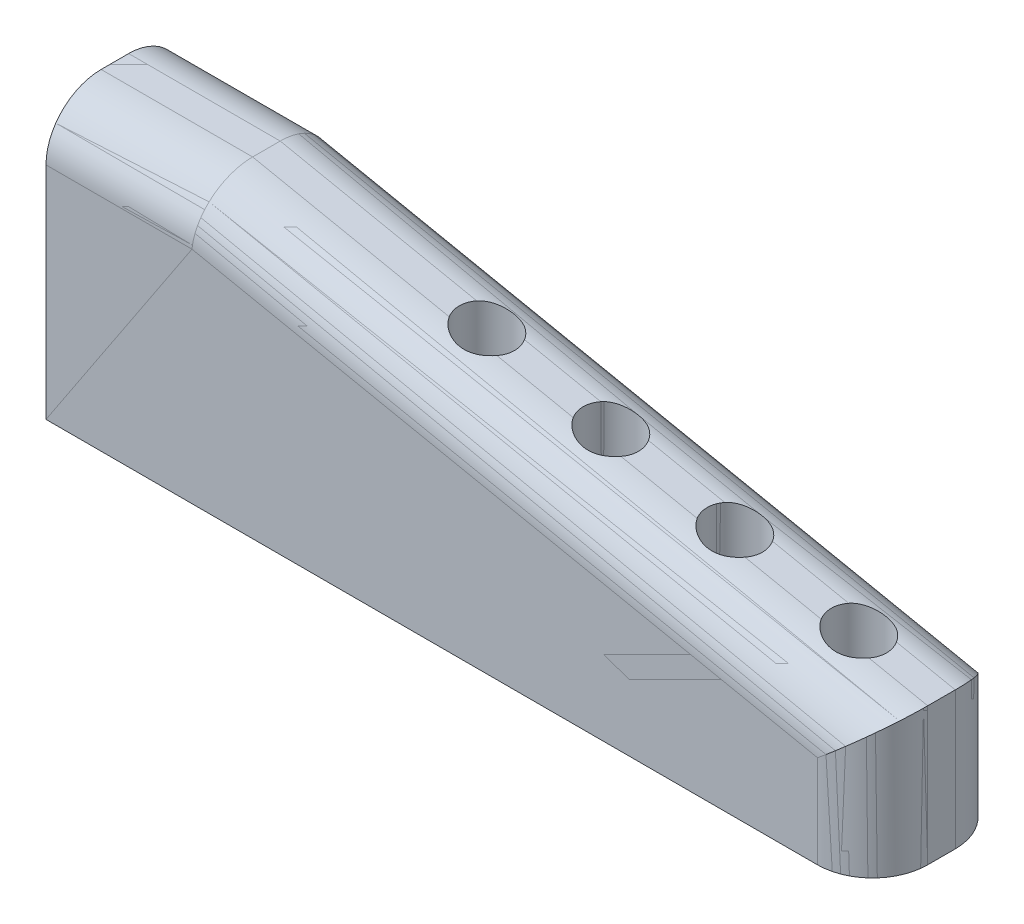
ISO-10303-21;
HEADER;
FILE_DESCRIPTION(('STEP AP214'),'2;1');
FILE_NAME('part.step','',(''),(''),'','','');
FILE_SCHEMA(('AUTOMOTIVE_DESIGN { 1 0 10303 214 1 1 1 1 }'));
ENDSEC;
DATA;
#1=APPLICATION_CONTEXT('core data for automotive mechanical design processes');
#2=APPLICATION_PROTOCOL_DEFINITION('international standard','automotive_design',2000,#1);
#3=PRODUCT_CONTEXT('',#1,'mechanical');
#4=PRODUCT('Part','Part','',(#3));
#5=PRODUCT_RELATED_PRODUCT_CATEGORY('part','',(#4));
#6=PRODUCT_DEFINITION_FORMATION('','',#4);
#7=PRODUCT_DEFINITION_CONTEXT('part definition',#1,'design');
#8=PRODUCT_DEFINITION('design','',#6,#7);
#9=PRODUCT_DEFINITION_SHAPE('','',#8);
#10=(LENGTH_UNIT() NAMED_UNIT(*) SI_UNIT(.MILLI.,.METRE.));
#11=(NAMED_UNIT(*) PLANE_ANGLE_UNIT() SI_UNIT($,.RADIAN.));
#12=(NAMED_UNIT(*) SI_UNIT($,.STERADIAN.) SOLID_ANGLE_UNIT());
#13=UNCERTAINTY_MEASURE_WITH_UNIT(LENGTH_MEASURE(1.E-05),#10,'distance_accuracy_value','');
#14=(GEOMETRIC_REPRESENTATION_CONTEXT(3) GLOBAL_UNCERTAINTY_ASSIGNED_CONTEXT((#13)) GLOBAL_UNIT_ASSIGNED_CONTEXT((#10,
#11,#12)) REPRESENTATION_CONTEXT('',''));
#15=CARTESIAN_POINT('',(0.,0.,0.));
#16=DIRECTION('',(0.,0.,1.));
#17=DIRECTION('',(1.,0.,0.));
#18=AXIS2_PLACEMENT_3D('',#15,#16,#17);
#19=CARTESIAN_POINT('',(34.6000799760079,13.040391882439,-3.));
#20=DIRECTION('',(-0.979804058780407,0.199960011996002,0.));
#21=DIRECTION('',(-0.199960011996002,-0.979804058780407,0.));
#22=AXIS2_PLACEMENT_3D('',#19,#20,#21);
#23=CYLINDRICAL_SURFACE('',#22,1.99999999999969);
#24=DIRECTION('',(-0.979804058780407,0.199960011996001,0.));
#25=VECTOR('',#24,1.);
#26=CARTESIAN_POINT('',(22.75,17.5,-2.99999999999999));
#27=LINE('',#26,#25);
#28=CARTESIAN_POINT('',(35.,14.9999999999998,-3.));
#29=VERTEX_POINT('',#28);
#30=CARTESIAN_POINT('',(32.8660254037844,15.4355050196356,-3.00000000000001));
#31=VERTEX_POINT('',#30);
#32=EDGE_CURVE('P0_E473',#29,#31,#27,.T.);
#33=ORIENTED_EDGE('',*,*,#32,.F.);
#34=CARTESIAN_POINT('',(33.,13.3669388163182,-3.));
#35=DIRECTION('',(-0.632471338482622,0.774583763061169,0.));
#36=DIRECTION('',(-0.774583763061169,-0.632471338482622,0.));
#37=AXIS2_PLACEMENT_3D('',#34,#35,#36);
#38=ELLIPSE('',#37,2.58203191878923,1.99999999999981);
#39=CARTESIAN_POINT('',(33.,13.3669388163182,-5.));
#40=VERTEX_POINT('',#39);
#41=EDGE_CURVE('P0_E354',#29,#40,#38,.T.);
#42=ORIENTED_EDGE('',*,*,#41,.T.);
#43=DIRECTION('',(0.979804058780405,-0.199960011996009,0.));
#44=VECTOR('',#43,1.);
#45=CARTESIAN_POINT('',(10.2980001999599,18.0000000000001,-5.));
#46=LINE('',#45,#44);
#47=CARTESIAN_POINT('',(10.2980001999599,18.0000000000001,-4.99999999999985));
#48=VERTEX_POINT('',#47);
#49=EDGE_CURVE('P0_E470',#48,#40,#46,.T.);
#50=ORIENTED_EDGE('',*,*,#49,.F.);
#51=CARTESIAN_POINT('',(10.29800019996,18.,-4.9999999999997));
#52=CARTESIAN_POINT('',(10.2991050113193,18.0109076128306,-5.00000000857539));
#53=CARTESIAN_POINT('',(10.30020982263,18.0218152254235,-4.99991075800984));
#54=CARTESIAN_POINT('',(10.3024188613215,18.0436275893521,-4.99955380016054));
#55=CARTESIAN_POINT('',(10.3035230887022,18.0545323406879,-4.9992860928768));
#56=CARTESIAN_POINT('',(10.3057303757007,18.0763361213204,-4.99857228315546));
#57=CARTESIAN_POINT('',(10.3068334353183,18.0872351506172,-4.99812618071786));
#58=CARTESIAN_POINT('',(10.3090378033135,18.1090246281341,-4.99705570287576));
#59=CARTESIAN_POINT('',(10.3101391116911,18.1199150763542,-4.99643132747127));
#60=CARTESIAN_POINT('',(10.3123393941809,18.1416845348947,-4.99500446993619));
#61=CARTESIAN_POINT('',(10.3134383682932,18.1525635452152,-4.99420198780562));
#62=CARTESIAN_POINT('',(10.3156333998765,18.1743072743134,-4.99241913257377));
#63=CARTESIAN_POINT('',(10.3167294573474,18.1851719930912,-4.9914387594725));
#64=CARTESIAN_POINT('',(10.3189180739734,18.206884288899,-4.98930038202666));
#65=CARTESIAN_POINT('',(10.3200106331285,18.2177318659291,-4.98814237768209));
#66=CARTESIAN_POINT('',(10.3221916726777,18.2394070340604,-4.98564905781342));
#67=CARTESIAN_POINT('',(10.3232801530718,18.2502346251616,-4.98431374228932));
#68=CARTESIAN_POINT('',(10.3243663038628,18.2610508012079,-4.98288993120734));
#69=B_SPLINE_CURVE_WITH_KNOTS('',3,(#51,#52,#53,#54,#55,#56,#57,#58,#59,#60,#61,#62,#63,#64,#65,
#66,#67,#68),.UNSPECIFIED.,.F.,.F.,(4,2,2,2,2,2,2,2,4),(0.,0.0328899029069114,
0.0657798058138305,0.0986697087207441,0.131559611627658,0.164449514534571,0.197339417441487,
0.230229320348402,0.263119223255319),.UNSPECIFIED.);
#70=CARTESIAN_POINT('',(10.3243663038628,18.2610508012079,-4.98288993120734));
#71=VERTEX_POINT('',#70);
#72=EDGE_CURVE('P0_E501',#48,#71,#69,.T.);
#73=ORIENTED_EDGE('',*,*,#72,.T.);
#74=CARTESIAN_POINT('',(10.2980001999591,18.,-3.00000000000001));
#75=DIRECTION('',(-0.994938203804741,0.100488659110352,0.));
#76=DIRECTION('',(0.100488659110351,0.994938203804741,0.));
#77=AXIS2_PLACEMENT_3D('',#74,#75,#76);
#78=ELLIPSE('',#77,2.01017509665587,1.99999999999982);
#79=CARTESIAN_POINT('',(10.4999999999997,19.9999999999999,-3.));
#80=VERTEX_POINT('',#79);
#81=EDGE_CURVE('P0_E493',#71,#80,#78,.F.);
#82=ORIENTED_EDGE('',*,*,#81,.T.);
#83=DIRECTION('',(-0.979804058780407,0.199960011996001,0.));
#84=VECTOR('',#83,1.);
#85=CARTESIAN_POINT('',(22.75,17.5,-2.99999999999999));
#86=LINE('',#85,#84);
#87=CARTESIAN_POINT('',(17.6339745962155,18.5440868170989,-3.));
#88=VERTEX_POINT('',#87);
#89=EDGE_CURVE('P0_E612',#88,#80,#86,.T.);
#90=ORIENTED_EDGE('',*,*,#89,.F.);
#91=CARTESIAN_POINT('',(19.3660254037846,18.1906070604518,-3.00000000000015));
#92=CARTESIAN_POINT('',(19.3442490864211,18.1950644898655,-3.03776138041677));
#93=CARTESIAN_POINT('',(19.3199428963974,18.1989202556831,-3.07411890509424));
#94=CARTESIAN_POINT('',(19.2667999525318,18.2059102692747,-3.14335683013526));
#95=CARTESIAN_POINT('',(19.23796935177,18.2090454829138,-3.17624185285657));
#96=CARTESIAN_POINT('',(19.1762565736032,18.2150845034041,-3.23795934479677));
#97=CARTESIAN_POINT('',(19.143375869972,18.2179883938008,-3.26679328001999));
#98=CARTESIAN_POINT('',(19.0741322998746,18.2240789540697,-3.31992467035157));
#99=CARTESIAN_POINT('',(19.037767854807,18.2272657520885,-3.34422005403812));
#100=CARTESIAN_POINT('',(18.9621788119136,18.2344012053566,-3.38786154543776));
#101=CARTESIAN_POINT('',(18.9229502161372,18.2383509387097,-3.40720055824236));
#102=CARTESIAN_POINT('',(18.8423066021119,18.2474158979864,-3.44060408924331));
#103=CARTESIAN_POINT('',(18.8008858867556,18.2525342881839,-3.45465400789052));
#104=CARTESIAN_POINT('',(18.7165701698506,18.2642183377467,-3.4772464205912));
#105=CARTESIAN_POINT('',(18.6736695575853,18.2707901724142,-3.48576478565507));
#106=CARTESIAN_POINT('',(18.5871310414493,18.2855035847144,-3.49715808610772));
#107=CARTESIAN_POINT('',(18.5434902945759,18.2936541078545,-3.49999976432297));
#108=CARTESIAN_POINT('',(18.4562183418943,18.3114644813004,-3.50000023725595));
#109=CARTESIAN_POINT('',(18.4125891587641,18.3211340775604,-3.49712083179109));
#110=CARTESIAN_POINT('',(18.3260836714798,18.3417343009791,-3.48573271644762));
#111=CARTESIAN_POINT('',(18.2832139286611,18.352672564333,-3.47718828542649));
#112=CARTESIAN_POINT('',(18.1989557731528,18.375387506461,-3.45461186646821));
#113=CARTESIAN_POINT('',(18.1575750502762,18.3871677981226,-3.44055490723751));
#114=CARTESIAN_POINT('',(18.0769994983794,18.4109986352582,-3.40717989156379));
#115=CARTESIAN_POINT('',(18.037808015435,18.4230495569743,-3.38785403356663));
#116=CARTESIAN_POINT('',(17.9622828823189,18.4467471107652,-3.34424925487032));
#117=CARTESIAN_POINT('',(17.9259426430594,18.4583946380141,-3.31998224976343));
#118=CARTESIAN_POINT('',(17.8567487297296,18.4805509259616,-3.26688881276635));
#119=CARTESIAN_POINT('',(17.8238749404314,18.4910662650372,-3.23809141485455));
#120=CARTESIAN_POINT('',(17.7621859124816,18.5102097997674,-3.1763965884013));
#121=CARTESIAN_POINT('',(17.733337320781,18.5188538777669,-3.14353771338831));
#122=CARTESIAN_POINT('',(17.6802084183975,18.5335469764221,-3.07431403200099));
#123=CARTESIAN_POINT('',(17.6558874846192,18.5396197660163,-3.03798532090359));
#124=CARTESIAN_POINT('',(17.6339745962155,18.5440868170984,-2.99999999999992));
#125=B_SPLINE_CURVE_WITH_KNOTS('',3,(#91,#92,#93,#94,#95,#96,#97,#98,#99,#100,#101,#102,#103,
#104,#105,#106,#107,#108,#109,#110,#111,#112,#113,#114,#115,#116,#117,#118,#119,#120,#121,#122,
#123,#124),.UNSPECIFIED.,.F.,.F.,(4,2,2,2,2,2,2,2,2,2,2,2,2,2,2,2,4),(0.,0.131338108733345,
0.262499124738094,0.393612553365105,0.52478567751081,0.656145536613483,0.787865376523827,
0.920155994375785,1.0532193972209,1.18717426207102,1.32198192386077,1.45740744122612,
1.59303457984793,1.72833844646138,1.86280808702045,1.99608729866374,2.12810605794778),.UNSPECIFIED.);
#126=CARTESIAN_POINT('',(19.3660254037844,18.1906070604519,-3.00000000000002));
#127=VERTEX_POINT('',#126);
#128=EDGE_CURVE('P0_E606',#127,#88,#125,.T.);
#129=ORIENTED_EDGE('',*,*,#128,.F.);
#130=DIRECTION('',(-0.979804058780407,0.199960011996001,0.));
#131=VECTOR('',#130,1.);
#132=CARTESIAN_POINT('',(22.75,17.5,-2.99999999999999));
#133=LINE('',#132,#131);
#134=CARTESIAN_POINT('',(22.1339745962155,17.6257194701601,-3.));
#135=VERTEX_POINT('',#134);
#136=EDGE_CURVE('P0_E605',#135,#127,#133,.T.);
#137=ORIENTED_EDGE('',*,*,#136,.F.);
#138=CARTESIAN_POINT('',(23.8660254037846,17.272239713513,-3.00000000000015));
#139=CARTESIAN_POINT('',(23.84424908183,17.2766971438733,-3.0377613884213));
#140=CARTESIAN_POINT('',(23.8199428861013,17.2805529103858,-3.07411892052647));
#141=CARTESIAN_POINT('',(23.7667999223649,17.2875429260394,-3.14335686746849));
#142=CARTESIAN_POINT('',(23.7379693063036,17.2906781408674,-3.17624190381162));
#143=CARTESIAN_POINT('',(23.6762565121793,17.296717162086,-3.23795940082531));
#144=CARTESIAN_POINT('',(23.6433758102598,17.2996210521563,-3.2667933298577));
#145=CARTESIAN_POINT('',(23.5741322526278,17.305711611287,-3.31992470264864));
#146=CARTESIAN_POINT('',(23.5377678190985,17.3088984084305,-3.34422007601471));
#147=CARTESIAN_POINT('',(23.4621787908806,17.3160338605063,-3.38786155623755));
#148=CARTESIAN_POINT('',(23.4229501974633,17.3199835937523,-3.40720056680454));
#149=CARTESIAN_POINT('',(23.3423065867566,17.3290485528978,-3.44060409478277));
#150=CARTESIAN_POINT('',(23.3008858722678,17.3341669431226,-3.45465401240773));
#151=CARTESIAN_POINT('',(23.2165701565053,17.3458509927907,-3.47724642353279));
#152=CARTESIAN_POINT('',(23.1736695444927,17.3524228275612,-3.48576478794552));
#153=CARTESIAN_POINT('',(23.0871310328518,17.3671362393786,-3.49715808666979));
#154=CARTESIAN_POINT('',(23.0434902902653,17.3752867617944,-3.4999997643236));
#155=CARTESIAN_POINT('',(22.9562183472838,17.3930971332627,-3.50000023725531));
#156=CARTESIAN_POINT('',(22.9125891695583,17.4027667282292,-3.49712083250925));
#157=CARTESIAN_POINT('',(22.8260836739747,17.4233669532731,-3.48573271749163));
#158=CARTESIAN_POINT('',(22.7832139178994,17.4343052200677,-3.4771882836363));
#159=CARTESIAN_POINT('',(22.6989557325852,17.4570201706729,-3.45461185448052));
#160=CARTESIAN_POINT('',(22.6575749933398,17.4688004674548,-3.44055488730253));
#161=CARTESIAN_POINT('',(22.5769994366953,17.4926313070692,-3.40717986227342));
#162=CARTESIAN_POINT('',(22.5378079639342,17.5046822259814,-3.38785400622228));
#163=CARTESIAN_POINT('',(22.4622828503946,17.5283797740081,-3.34424923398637));
#164=CARTESIAN_POINT('',(22.4259426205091,17.5400272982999,-3.31998223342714));
#165=CARTESIAN_POINT('',(22.3567486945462,17.5621835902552,-3.26688878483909));
#166=CARTESIAN_POINT('',(22.3238748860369,17.5726989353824,-3.23809136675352));
#167=CARTESIAN_POINT('',(22.2621858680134,17.5918424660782,-3.17639653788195));
#168=CARTESIAN_POINT('',(22.2333373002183,17.6004865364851,-3.14353768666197));
#169=CARTESIAN_POINT('',(22.1802084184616,17.6151796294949,-3.0743140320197));
#170=CARTESIAN_POINT('',(22.1558874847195,17.6212524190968,-3.0379853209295));
#171=CARTESIAN_POINT('',(22.1339745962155,17.6257194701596,-2.99999999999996));
#172=B_SPLINE_CURVE_WITH_KNOTS('',3,(#138,#139,#140,#141,#142,#143,#144,#145,#146,#147,#148,
#149,#150,#151,#152,#153,#154,#155,#156,#157,#158,#159,#160,#161,#162,#163,#164,#165,#166,#167,
#168,#169,#170,#171),.UNSPECIFIED.,.F.,.F.,(4,2,2,2,2,2,2,2,2,2,2,2,2,2,2,2,4),(0.,
0.131338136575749,0.262499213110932,0.393612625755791,0.524785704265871,0.656145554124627,
0.78786539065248,0.920156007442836,1.05321939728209,1.18717424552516,1.32198194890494,
1.45740752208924,1.5930346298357,1.72833846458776,1.8628081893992,1.99608729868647,
2.12810605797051),.UNSPECIFIED.);
#173=CARTESIAN_POINT('',(23.8660254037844,17.2722397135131,-3.00000000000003));
#174=VERTEX_POINT('',#173);
#175=EDGE_CURVE('P0_E590',#174,#135,#172,.T.);
#176=ORIENTED_EDGE('',*,*,#175,.F.);
#177=DIRECTION('',(-0.979804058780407,0.199960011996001,0.));
#178=VECTOR('',#177,1.);
#179=CARTESIAN_POINT('',(22.75,17.5,-2.99999999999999));
#180=LINE('',#179,#178);
#181=CARTESIAN_POINT('',(26.6339745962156,16.7073521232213,-3.));
#182=VERTEX_POINT('',#181);
#183=EDGE_CURVE('P0_E596',#182,#174,#180,.T.);
#184=ORIENTED_EDGE('',*,*,#183,.F.);
#185=CARTESIAN_POINT('',(28.3660254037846,16.3538723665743,-3.00000000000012));
#186=CARTESIAN_POINT('',(28.3442490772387,16.3583297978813,-3.03776139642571));
#187=CARTESIAN_POINT('',(28.3199428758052,16.3621855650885,-3.07411893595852));
#188=CARTESIAN_POINT('',(28.2667998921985,16.3691755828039,-3.14335690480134));
#189=CARTESIAN_POINT('',(28.2379692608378,16.3723107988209,-3.17624195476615));
#190=CARTESIAN_POINT('',(28.1762564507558,16.378349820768,-3.23795945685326));
#191=CARTESIAN_POINT('',(28.1433757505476,16.381253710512,-3.26679337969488));
#192=CARTESIAN_POINT('',(28.0741322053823,16.387344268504,-3.31992473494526));
#193=CARTESIAN_POINT('',(28.0377677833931,16.3905310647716,-3.34422009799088));
#194=CARTESIAN_POINT('',(27.9621787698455,16.3976665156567,-3.38786156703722));
#195=CARTESIAN_POINT('',(27.9229501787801,16.401616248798,-3.4072005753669));
#196=CARTESIAN_POINT('',(27.8423065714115,16.4106812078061,-3.44060410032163));
#197=CARTESIAN_POINT('',(27.8008858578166,16.4157995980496,-3.45465401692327));
#198=CARTESIAN_POINT('',(27.7165701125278,16.4274836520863,-3.4772464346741));
#199=CARTESIAN_POINT('',(27.6736694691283,16.4340554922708,-3.48576480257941));
#200=CARTESIAN_POINT('',(27.5871309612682,16.4487689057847,-3.49715809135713));
#201=CARTESIAN_POINT('',(27.5434902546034,16.4569194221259,-3.49999976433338));
#202=CARTESIAN_POINT('',(27.4562183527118,16.4747297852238,-3.50000023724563));
#203=CARTESIAN_POINT('',(27.4125891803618,16.4843993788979,-3.49712083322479));
#204=CARTESIAN_POINT('',(27.3260836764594,16.5049996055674,-3.48573271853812));
#205=CARTESIAN_POINT('',(27.2832139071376,16.5159378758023,-3.4771882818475));
#206=CARTESIAN_POINT('',(27.198955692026,16.5386528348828,-3.4546118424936));
#207=CARTESIAN_POINT('',(27.1575749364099,16.550433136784,-3.44055486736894));
#208=CARTESIAN_POINT('',(27.076999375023,16.5742639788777,-3.40717983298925));
#209=CARTESIAN_POINT('',(27.0378079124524,16.5863148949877,-3.38785397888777));
#210=CARTESIAN_POINT('',(26.9622828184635,16.610012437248,-3.34424921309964));
#211=CARTESIAN_POINT('',(26.9259425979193,16.6216599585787,-3.31998221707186));
#212=CARTESIAN_POINT('',(26.8567486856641,16.6438162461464,-3.26688877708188));
#213=CARTESIAN_POINT('',(26.8238748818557,16.654331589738,-3.23809136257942));
#214=CARTESIAN_POINT('',(26.7621858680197,16.6734751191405,-3.17639653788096));
#215=CARTESIAN_POINT('',(26.7333373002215,16.6821191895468,-3.1435376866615));
#216=CARTESIAN_POINT('',(26.6802084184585,16.6968122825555,-3.07431403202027));
#217=CARTESIAN_POINT('',(26.6558874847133,16.702885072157,-3.03798532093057));
#218=CARTESIAN_POINT('',(26.6339745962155,16.7073521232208,-2.99999999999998));
#219=B_SPLINE_CURVE_WITH_KNOTS('',3,(#185,#186,#187,#188,#189,#190,#191,#192,#193,#194,#195,
#196,#197,#198,#199,#200,#201,#202,#203,#204,#205,#206,#207,#208,#209,#210,#211,#212,#213,#214,
#215,#216,#217,#218),.UNSPECIFIED.,.F.,.F.,(4,2,2,2,2,2,2,2,2,2,2,2,2,2,2,2,4),(0.,
0.131338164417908,0.262499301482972,0.393612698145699,0.524785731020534,0.656145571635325,
0.787865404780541,0.920156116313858,1.05321939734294,1.18717422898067,1.32198197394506,
1.45740760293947,1.59303467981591,1.7283384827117,1.8628081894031,1.99608729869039,
2.12810605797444),.UNSPECIFIED.);
#220=CARTESIAN_POINT('',(28.3660254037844,16.3538723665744,-3.00000000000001));
#221=VERTEX_POINT('',#220);
#222=EDGE_CURVE('P0_E629',#221,#182,#219,.T.);
#223=ORIENTED_EDGE('',*,*,#222,.F.);
#224=DIRECTION('',(-0.979804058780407,0.199960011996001,0.));
#225=VECTOR('',#224,1.);
#226=CARTESIAN_POINT('',(22.75,17.5,-2.99999999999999));
#227=LINE('',#226,#225);
#228=CARTESIAN_POINT('',(31.1339745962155,15.7889847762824,-3.));
#229=VERTEX_POINT('',#228);
#230=EDGE_CURVE('P0_E625',#229,#221,#227,.T.);
#231=ORIENTED_EDGE('',*,*,#230,.F.);
#232=CARTESIAN_POINT('',(32.8660254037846,15.4355050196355,-3.00000000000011));
#233=CARTESIAN_POINT('',(32.8442490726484,15.4399624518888,-3.03776140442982));
#234=CARTESIAN_POINT('',(32.8199428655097,15.4438182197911,-3.07411895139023));
#235=CARTESIAN_POINT('',(32.766799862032,15.4508082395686,-3.1433569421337));
#236=CARTESIAN_POINT('',(32.7379692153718,15.4539434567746,-3.17624200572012));
#237=CARTESIAN_POINT('',(32.6762563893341,15.4599824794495,-3.23795951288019));
#238=CARTESIAN_POINT('',(32.6433756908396,15.4628863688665,-3.26679342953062));
#239=CARTESIAN_POINT('',(32.5741321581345,15.4689769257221,-3.31992476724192));
#240=CARTESIAN_POINT('',(32.5377677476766,15.4721637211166,-3.34422011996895));
#241=CARTESIAN_POINT('',(32.4621787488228,15.479299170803,-3.38786157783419));
#242=CARTESIAN_POINT('',(32.4229501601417,15.4832489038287,-3.40720058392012));
#243=CARTESIAN_POINT('',(32.3423065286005,15.4923138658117,-3.44060411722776));
#244=CARTESIAN_POINT('',(32.3008857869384,15.4974322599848,-3.45465404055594));
#245=CARTESIAN_POINT('',(32.2165700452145,15.5091163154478,-3.47724644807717));
#246=CARTESIAN_POINT('',(32.1736694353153,15.5156881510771,-3.48576480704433));
#247=CARTESIAN_POINT('',(32.0871309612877,15.5304015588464,-3.49715809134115));
#248=CARTESIAN_POINT('',(32.0434902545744,15.538552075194,-3.49999976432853));
#249=CARTESIAN_POINT('',(31.9562183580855,15.5563624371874,-3.50000023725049));
#250=CARTESIAN_POINT('',(31.9125891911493,15.5660320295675,-3.49712083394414));
#251=CARTESIAN_POINT('',(31.8260836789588,15.5866322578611,-3.48573271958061));
#252=CARTESIAN_POINT('',(31.7832138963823,15.5975705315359,-3.47718828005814));
#253=CARTESIAN_POINT('',(31.6989556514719,15.6202854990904,-3.45461183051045));
#254=CARTESIAN_POINT('',(31.657574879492,15.6320658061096,-3.44055484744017));
#255=CARTESIAN_POINT('',(31.5769993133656,15.6558966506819,-3.4071798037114));
#256=CARTESIAN_POINT('',(31.5378078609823,15.6679475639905,-3.38785395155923));
#257=CARTESIAN_POINT('',(31.4622827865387,15.6916451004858,-3.34424919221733));
#258=CARTESIAN_POINT('',(31.4259425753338,15.7032926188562,-3.31998220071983));
#259=CARTESIAN_POINT('',(31.3567486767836,15.7254489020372,-3.26688876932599));
#260=CARTESIAN_POINT('',(31.3238748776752,15.7359642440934,-3.23809135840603));
#261=CARTESIAN_POINT('',(31.262185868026,15.7551077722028,-3.17639653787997));
#262=CARTESIAN_POINT('',(31.2333373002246,15.7637518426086,-3.14353768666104));
#263=CARTESIAN_POINT('',(31.1802084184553,15.7784449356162,-3.07431403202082));
#264=CARTESIAN_POINT('',(31.1558874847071,15.7845177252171,-3.03798532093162));
#265=CARTESIAN_POINT('',(31.1339745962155,15.788984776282,-2.99999999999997));
#266=B_SPLINE_CURVE_WITH_KNOTS('',3,(#232,#233,#234,#235,#236,#237,#238,#239,#240,#241,#242,
#243,#244,#245,#246,#247,#248,#249,#250,#251,#252,#253,#254,#255,#256,#257,#258,#259,#260,#261,
#262,#263,#264,#265),.UNSPECIFIED.,.F.,.F.,(4,2,2,2,2,2,2,2,2,2,2,2,2,2,2,2,4),(0.,
0.131338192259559,0.262499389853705,0.393612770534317,0.524785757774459,0.65614558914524,
0.787865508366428,0.920156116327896,1.05321939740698,1.18717421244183,1.32198199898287,
1.45740768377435,1.59303472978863,1.72833850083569,1.8628081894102,1.9960872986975,
2.12810605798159),.UNSPECIFIED.);
#267=EDGE_CURVE('P0_E506',#31,#229,#266,.T.);
#268=ORIENTED_EDGE('',*,*,#267,.F.);
#269=EDGE_LOOP('',(#33,#42,#50,#73,#82,#90,#129,#137,#176,#184,#223,#231,#268));
#270=FACE_BOUND('',#269,.T.);
#271=ADVANCED_FACE('P0_F350',(#270),#23,.T.);
#272=CARTESIAN_POINT('',(11.,15.5,-3.5));
#273=DIRECTION('',(1.,0.,0.));
#274=DIRECTION('',(0.,0.,1.));
#275=AXIS2_PLACEMENT_3D('',#272,#273,#274);
#276=PLANE('',#275);
#277=CARTESIAN_POINT('',(11.,14.5,-2.5));
#278=DIRECTION('',(-1.,0.,0.));
#279=DIRECTION('',(0.,0.,1.));
#280=AXIS2_PLACEMENT_3D('',#277,#278,#279);
#281=CIRCLE('',#280,1.);
#282=CARTESIAN_POINT('',(11.,14.5,-1.5));
#283=VERTEX_POINT('',#282);
#284=EDGE_CURVE('P0_E486',#283,#283,#281,.F.);
#285=ORIENTED_EDGE('',*,*,#284,.F.);
#286=EDGE_LOOP('',(#285));
#287=FACE_BOUND('',#286,.T.);
#288=ADVANCED_FACE('P0_F703',(#287),#276,.F.);
#289=CARTESIAN_POINT('',(33.,10.,-3.));
#290=DIRECTION('',(0.,1.,0.));
#291=DIRECTION('',(-1.,0.,0.));
#292=AXIS2_PLACEMENT_3D('',#289,#290,#291);
#293=CYLINDRICAL_SURFACE('',#292,1.99999999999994);
#294=ORIENTED_EDGE('',*,*,#41,.F.);
#295=DIRECTION('',(0.,1.,0.));
#296=VECTOR('',#295,1.);
#297=CARTESIAN_POINT('',(35.,12.5,-3.));
#298=LINE('',#297,#296);
#299=CARTESIAN_POINT('',(35.,10.,-3.));
#300=VERTEX_POINT('',#299);
#301=EDGE_CURVE('P0_E477',#300,#29,#298,.T.);
#302=ORIENTED_EDGE('',*,*,#301,.F.);
#303=CARTESIAN_POINT('',(33.,10.,-3.));
#304=DIRECTION('',(0.,1.,0.));
#305=DIRECTION('',(-1.,0.,0.));
#306=AXIS2_PLACEMENT_3D('',#303,#304,#305);
#307=CIRCLE('',#306,1.99999999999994);
#308=CARTESIAN_POINT('',(33.,10.,-5.00000000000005));
#309=VERTEX_POINT('',#308);
#310=EDGE_CURVE('P0_E482',#309,#300,#307,.F.);
#311=ORIENTED_EDGE('',*,*,#310,.F.);
#312=DIRECTION('',(0.,-1.,0.));
#313=VECTOR('',#312,1.);
#314=CARTESIAN_POINT('',(33.,24.,-5.));
#315=LINE('',#314,#313);
#316=EDGE_CURVE('P0_E479',#40,#309,#315,.T.);
#317=ORIENTED_EDGE('',*,*,#316,.F.);
#318=EDGE_LOOP('',(#294,#302,#311,#317));
#319=FACE_BOUND('',#318,.T.);
#320=ADVANCED_FACE('P0_F480',(#319),#293,.T.);
#321=CARTESIAN_POINT('',(35.,10.,-2.));
#322=DIRECTION('',(1.,0.,0.));
#323=DIRECTION('',(0.,0.,-1.));
#324=AXIS2_PLACEMENT_3D('',#321,#322,#323);
#325=PLANE('',#324);
#326=DIRECTION('',(0.,0.,-1.));
#327=VECTOR('',#326,1.);
#328=CARTESIAN_POINT('',(35.,15.,-14.50249975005));
#329=LINE('',#328,#327);
#330=CARTESIAN_POINT('',(34.9999999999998,14.9999999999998,-1.99999999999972));
#331=VERTEX_POINT('',#330);
#332=EDGE_CURVE('P0_E513',#331,#29,#329,.T.);
#333=ORIENTED_EDGE('',*,*,#332,.F.);
#334=DIRECTION('',(0.,-1.,0.));
#335=VECTOR('',#334,1.);
#336=CARTESIAN_POINT('',(34.9999999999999,12.5,-1.99999999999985));
#337=LINE('',#336,#335);
#338=CARTESIAN_POINT('',(35.,10.,-1.99999999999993));
#339=VERTEX_POINT('',#338);
#340=EDGE_CURVE('P0_E726',#331,#339,#337,.T.);
#341=ORIENTED_EDGE('',*,*,#340,.T.);
#342=DIRECTION('',(0.,0.,1.));
#343=VECTOR('',#342,1.);
#344=CARTESIAN_POINT('',(35.,10.,-15.));
#345=LINE('',#344,#343);
#346=EDGE_CURVE('P0_E685',#300,#339,#345,.T.);
#347=ORIENTED_EDGE('',*,*,#346,.F.);
#348=ORIENTED_EDGE('',*,*,#301,.T.);
#349=EDGE_LOOP('',(#333,#341,#347,#348));
#350=FACE_BOUND('',#349,.T.);
#351=ADVANCED_FACE('P0_F709',(#350),#325,.T.);
#352=CARTESIAN_POINT('',(35.,15.,-2.));
#353=DIRECTION('',(0.199960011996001,0.979804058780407,0.));
#354=DIRECTION('',(0.,0.,-1.));
#355=AXIS2_PLACEMENT_3D('',#352,#353,#354);
#356=PLANE('',#355);
#357=CARTESIAN_POINT('',(18.5,18.3673469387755,-2.5));
#358=DIRECTION('',(0.199960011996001,0.979804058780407,0.));
#359=DIRECTION('',(0.979804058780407,-0.199960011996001,0.));
#360=AXIS2_PLACEMENT_3D('',#357,#358,#359);
#361=ELLIPSE('',#360,1.02061222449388,1.);
#362=CARTESIAN_POINT('',(17.6339745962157,18.5440868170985,-1.99999999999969));
#363=VERTEX_POINT('',#362);
#364=EDGE_CURVE('P0_E610',#88,#363,#361,.T.);
#365=ORIENTED_EDGE('',*,*,#364,.F.);
#366=ORIENTED_EDGE('',*,*,#89,.T.);
#367=DIRECTION('',(0.,0.,-1.));
#368=VECTOR('',#367,1.);
#369=CARTESIAN_POINT('',(10.5,20.,-4.75));
#370=LINE('',#369,#368);
#371=CARTESIAN_POINT('',(10.4999999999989,20.,-1.99999999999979));
#372=VERTEX_POINT('',#371);
#373=EDGE_CURVE('P0_E505',#372,#80,#370,.T.);
#374=ORIENTED_EDGE('',*,*,#373,.F.);
#375=DIRECTION('',(0.979804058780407,-0.199960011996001,0.));
#376=VECTOR('',#375,1.);
#377=CARTESIAN_POINT('',(22.7499999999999,17.4999999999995,-1.99999999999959));
#378=LINE('',#377,#376);
#379=EDGE_CURVE('P0_E730',#372,#363,#378,.T.);
#380=ORIENTED_EDGE('',*,*,#379,.T.);
#381=EDGE_LOOP('',(#365,#366,#374,#380));
#382=FACE_BOUND('',#381,.T.);
#383=ADVANCED_FACE('P0_F749',(#382),#356,.T.);
#384=CARTESIAN_POINT('',(18.5,18.571428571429,-2.5));
#385=DIRECTION('',(0.,-1.,0.));
#386=DIRECTION('',(0.,0.,-1.));
#387=AXIS2_PLACEMENT_3D('',#384,#385,#386);
#388=CYLINDRICAL_SURFACE('',#387,1.);
#389=ORIENTED_EDGE('',*,*,#128,.T.);
#390=ORIENTED_EDGE('',*,*,#364,.T.);
#391=CARTESIAN_POINT('',(17.6339745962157,18.5440868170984,-1.99999999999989));
#392=CARTESIAN_POINT('',(17.6558874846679,18.5396197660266,-1.96201467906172));
#393=CARTESIAN_POINT('',(17.6802084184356,18.533546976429,-1.92568596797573));
#394=CARTESIAN_POINT('',(17.7333373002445,18.5188538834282,-1.85646231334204));
#395=CARTESIAN_POINT('',(17.762185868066,18.5102098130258,-1.82360346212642));
#396=CARTESIAN_POINT('',(17.8238748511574,18.4910662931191,-1.76190866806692));
#397=CARTESIAN_POINT('',(17.8567486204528,18.4805509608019,-1.73311127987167));
#398=CARTESIAN_POINT('',(17.9259424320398,18.4583947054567,-1.68001790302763));
#399=CARTESIAN_POINT('',(17.9622825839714,18.4467472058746,-1.65575094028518));
#400=CARTESIAN_POINT('',(18.0378075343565,18.4230497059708,-1.61214622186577));
#401=CARTESIAN_POINT('',(18.0769989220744,18.4109988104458,-1.59282038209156));
#402=CARTESIAN_POINT('',(18.1575745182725,18.3871679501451,-1.55944527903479));
#403=CARTESIAN_POINT('',(18.1989553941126,18.3753876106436,-1.54538824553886));
#404=CARTESIAN_POINT('',(18.2832138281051,18.3526725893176,-1.52281173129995));
#405=CARTESIAN_POINT('',(18.3260836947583,18.3417342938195,-1.51426727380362));
#406=CARTESIAN_POINT('',(18.4125892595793,18.3211340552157,-1.5028791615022));
#407=CARTESIAN_POINT('',(18.4562183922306,18.3114644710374,-1.49999976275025));
#408=CARTESIAN_POINT('',(18.5434902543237,18.2936541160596,-1.50000023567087));
#409=CARTESIAN_POINT('',(18.5871309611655,18.285503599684,-1.5028419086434));
#410=CARTESIAN_POINT('',(18.6736694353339,18.2707901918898,-1.51423519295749));
#411=CARTESIAN_POINT('',(18.7165700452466,18.2642183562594,-1.52275355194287));
#412=CARTESIAN_POINT('',(18.8008857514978,18.2525343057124,-1.5453459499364));
#413=CARTESIAN_POINT('',(18.8423064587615,18.2474159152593,-1.55939585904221));
#414=CARTESIAN_POINT('',(18.9229500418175,18.2383509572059,-1.59279936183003));
#415=CARTESIAN_POINT('',(18.9621786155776,18.2344012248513,-1.61213835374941));
#416=CARTESIAN_POINT('',(19.0377675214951,18.227265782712,-1.6557797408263));
#417=CARTESIAN_POINT('',(19.0741318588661,18.2240789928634,-1.68007502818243));
#418=CARTESIAN_POINT('',(19.1433753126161,18.2179884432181,-1.73320625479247));
#419=CARTESIAN_POINT('',(19.176256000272,18.215084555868,-1.76204013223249));
#420=CARTESIAN_POINT('',(19.237968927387,18.2090455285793,-1.82375767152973));
#421=CARTESIAN_POINT('',(19.266799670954,18.2059103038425,-1.8566428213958));
#422=CARTESIAN_POINT('',(19.3199428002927,18.198920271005,-1.92588095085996));
#423=CARTESIAN_POINT('',(19.3442490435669,18.1950644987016,-1.96223854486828));
#424=CARTESIAN_POINT('',(19.3660254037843,18.1906070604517,-1.99999999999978));
#425=B_SPLINE_CURVE_WITH_KNOTS('',3,(#391,#392,#393,#394,#395,#396,#397,#398,#399,#400,#401,
#402,#403,#404,#405,#406,#407,#408,#409,#410,#411,#412,#413,#414,#415,#416,#417,#418,#419,#420,
#421,#422,#423,#424),.UNSPECIFIED.,.F.,.F.,(4,2,2,2,2,2,2,2,2,2,2,2,2,2,2,2,4),(0.,
0.132018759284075,0.265297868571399,0.399767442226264,0.535071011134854,0.670697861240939,
0.806123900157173,0.940931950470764,1.07488666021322,1.20794994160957,1.34024054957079,
1.47196035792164,1.60332013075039,1.73449282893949,1.86560610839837,1.99676768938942,
2.12810605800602),.UNSPECIFIED.);
#426=CARTESIAN_POINT('',(19.3660254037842,18.1906070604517,-1.99999999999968));
#427=VERTEX_POINT('',#426);
#428=EDGE_CURVE('P0_E574',#363,#427,#425,.T.);
#429=ORIENTED_EDGE('',*,*,#428,.T.);
#430=CARTESIAN_POINT('',(18.5,18.3673469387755,-2.5));
#431=DIRECTION('',(0.199960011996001,0.979804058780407,0.));
#432=DIRECTION('',(0.979804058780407,-0.199960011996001,0.));
#433=AXIS2_PLACEMENT_3D('',#430,#431,#432);
#434=ELLIPSE('',#433,1.02061222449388,1.);
#435=EDGE_CURVE('P0_E602',#127,#427,#434,.F.);
#436=ORIENTED_EDGE('',*,*,#435,.F.);
#437=EDGE_LOOP('',(#389,#390,#429,#436));
#438=FACE_BOUND('',#437,.T.);
#439=CARTESIAN_POINT('',(18.5,10.,-2.5));
#440=DIRECTION('',(0.,-1.,0.));
#441=DIRECTION('',(0.,0.,-1.));
#442=AXIS2_PLACEMENT_3D('',#439,#440,#441);
#443=CIRCLE('',#442,1.);
#444=CARTESIAN_POINT('',(18.5,10.,-3.5));
#445=VERTEX_POINT('',#444);
#446=EDGE_CURVE('P0_E728',#445,#445,#443,.F.);
#447=ORIENTED_EDGE('',*,*,#446,.F.);
#448=EDGE_LOOP('',(#447));
#449=FACE_BOUND('',#448,.T.);
#450=ADVANCED_FACE('P0_F586',(#438,#449),#388,.F.);
#451=CARTESIAN_POINT('',(35.,15.,-2.));
#452=DIRECTION('',(0.199960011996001,0.979804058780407,0.));
#453=DIRECTION('',(0.,0.,-1.));
#454=AXIS2_PLACEMENT_3D('',#451,#452,#453);
#455=PLANE('',#454);
#456=CARTESIAN_POINT('',(23.,17.4489795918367,-2.5));
#457=DIRECTION('',(0.199960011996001,0.979804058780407,0.));
#458=DIRECTION('',(0.979804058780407,-0.199960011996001,0.));
#459=AXIS2_PLACEMENT_3D('',#456,#457,#458);
#460=ELLIPSE('',#459,1.02061222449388,1.);
#461=CARTESIAN_POINT('',(22.1339745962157,17.6257194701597,-1.99999999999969));
#462=VERTEX_POINT('',#461);
#463=EDGE_CURVE('P0_E597',#135,#462,#460,.T.);
#464=ORIENTED_EDGE('',*,*,#463,.F.);
#465=ORIENTED_EDGE('',*,*,#136,.T.);
#466=ORIENTED_EDGE('',*,*,#435,.T.);
#467=DIRECTION('',(0.979804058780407,-0.199960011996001,0.));
#468=VECTOR('',#467,1.);
#469=CARTESIAN_POINT('',(22.7499999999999,17.4999999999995,-1.99999999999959));
#470=LINE('',#469,#468);
#471=EDGE_CURVE('P0_E573',#427,#462,#470,.T.);
#472=ORIENTED_EDGE('',*,*,#471,.T.);
#473=EDGE_LOOP('',(#464,#465,#466,#472));
#474=FACE_BOUND('',#473,.T.);
#475=ADVANCED_FACE('P0_F584',(#474),#455,.T.);
#476=CARTESIAN_POINT('',(23.,17.65306122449,-2.5));
#477=DIRECTION('',(0.,-1.,0.));
#478=DIRECTION('',(0.,0.,-1.));
#479=AXIS2_PLACEMENT_3D('',#476,#477,#478);
#480=CYLINDRICAL_SURFACE('',#479,1.);
#481=ORIENTED_EDGE('',*,*,#175,.T.);
#482=ORIENTED_EDGE('',*,*,#463,.T.);
#483=CARTESIAN_POINT('',(22.1339745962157,17.6257194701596,-1.99999999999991));
#484=CARTESIAN_POINT('',(22.1558874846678,17.6212524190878,-1.96201467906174));
#485=CARTESIAN_POINT('',(22.1802084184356,17.6151796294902,-1.92568596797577));
#486=CARTESIAN_POINT('',(22.2333373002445,17.6004865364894,-1.85646231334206));
#487=CARTESIAN_POINT('',(22.2621858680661,17.5918424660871,-1.82360346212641));
#488=CARTESIAN_POINT('',(22.3238748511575,17.5726989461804,-1.76190866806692));
#489=CARTESIAN_POINT('',(22.3567486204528,17.5621836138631,-1.73311127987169));
#490=CARTESIAN_POINT('',(22.4259424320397,17.5400273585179,-1.68001790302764));
#491=CARTESIAN_POINT('',(22.4622825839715,17.5283798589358,-1.65575094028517));
#492=CARTESIAN_POINT('',(22.5378075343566,17.504682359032,-1.61214622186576));
#493=CARTESIAN_POINT('',(22.5769989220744,17.492631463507,-1.59282038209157));
#494=CARTESIAN_POINT('',(22.6575745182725,17.4688006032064,-1.55944527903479));
#495=CARTESIAN_POINT('',(22.6989553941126,17.4570202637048,-1.54538824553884));
#496=CARTESIAN_POINT('',(22.7832138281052,17.4343052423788,-1.52281173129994));
#497=CARTESIAN_POINT('',(22.8260836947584,17.4233669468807,-1.5142672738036));
#498=CARTESIAN_POINT('',(22.9125892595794,17.4027667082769,-1.50287916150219));
#499=CARTESIAN_POINT('',(22.9562183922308,17.3930971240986,-1.49999976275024));
#500=CARTESIAN_POINT('',(23.0434902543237,17.3752867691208,-1.50000023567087));
#501=CARTESIAN_POINT('',(23.0871309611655,17.3671362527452,-1.5028419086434));
#502=CARTESIAN_POINT('',(23.1736694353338,17.352422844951,-1.51423519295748));
#503=CARTESIAN_POINT('',(23.2165700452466,17.3458510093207,-1.52275355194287));
#504=CARTESIAN_POINT('',(23.3008857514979,17.3341669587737,-1.54534594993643));
#505=CARTESIAN_POINT('',(23.3423064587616,17.3290485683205,-1.55939585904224));
#506=CARTESIAN_POINT('',(23.4229500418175,17.3199836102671,-1.59279936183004));
#507=CARTESIAN_POINT('',(23.4621786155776,17.3160338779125,-1.61213835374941));
#508=CARTESIAN_POINT('',(23.537767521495,17.3088984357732,-1.65577974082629));
#509=CARTESIAN_POINT('',(23.5741318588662,17.3057116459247,-1.68007502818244));
#510=CARTESIAN_POINT('',(23.6433753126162,17.2996210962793,-1.73320625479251));
#511=CARTESIAN_POINT('',(23.6762560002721,17.2967172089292,-1.76204013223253));
#512=CARTESIAN_POINT('',(23.7379689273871,17.2906781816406,-1.82375767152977));
#513=CARTESIAN_POINT('',(23.766799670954,17.2875429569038,-1.85664282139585));
#514=CARTESIAN_POINT('',(23.8199428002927,17.2805529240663,-1.92588095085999));
#515=CARTESIAN_POINT('',(23.8442490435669,17.2766971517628,-1.96223854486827));
#516=CARTESIAN_POINT('',(23.8660254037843,17.2722397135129,-1.99999999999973));
#517=B_SPLINE_CURVE_WITH_KNOTS('',3,(#483,#484,#485,#486,#487,#488,#489,#490,#491,#492,#493,
#494,#495,#496,#497,#498,#499,#500,#501,#502,#503,#504,#505,#506,#507,#508,#509,#510,#511,#512,
#513,#514,#515,#516),.UNSPECIFIED.,.F.,.F.,(4,2,2,2,2,2,2,2,2,2,2,2,2,2,2,2,4),(0.,
0.132018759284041,0.265297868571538,0.399767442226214,0.535071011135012,0.670697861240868,
0.806123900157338,0.940931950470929,1.07488666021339,1.20794994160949,1.34024054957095,
1.47196035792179,1.60332013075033,1.73449282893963,1.86560610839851,1.99676768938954,
2.12810605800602),.UNSPECIFIED.);
#518=CARTESIAN_POINT('',(23.8660254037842,17.2722397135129,-1.99999999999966));
#519=VERTEX_POINT('',#518);
#520=EDGE_CURVE('P0_E568',#462,#519,#517,.T.);
#521=ORIENTED_EDGE('',*,*,#520,.T.);
#522=CARTESIAN_POINT('',(23.,17.4489795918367,-2.5));
#523=DIRECTION('',(0.199960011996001,0.979804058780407,0.));
#524=DIRECTION('',(0.979804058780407,-0.199960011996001,0.));
#525=AXIS2_PLACEMENT_3D('',#522,#523,#524);
#526=ELLIPSE('',#525,1.02061222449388,1.);
#527=EDGE_CURVE('P0_E598',#174,#519,#526,.F.);
#528=ORIENTED_EDGE('',*,*,#527,.F.);
#529=EDGE_LOOP('',(#481,#482,#521,#528));
#530=FACE_BOUND('',#529,.T.);
#531=CARTESIAN_POINT('',(23.,10.,-2.5));
#532=DIRECTION('',(0.,-1.,0.));
#533=DIRECTION('',(0.,0.,-1.));
#534=AXIS2_PLACEMENT_3D('',#531,#532,#533);
#535=CIRCLE('',#534,1.);
#536=CARTESIAN_POINT('',(23.,10.,-3.5));
#537=VERTEX_POINT('',#536);
#538=EDGE_CURVE('P0_E732',#537,#537,#535,.F.);
#539=ORIENTED_EDGE('',*,*,#538,.F.);
#540=EDGE_LOOP('',(#539));
#541=FACE_BOUND('',#540,.T.);
#542=ADVANCED_FACE('P0_F580',(#530,#541),#480,.F.);
#543=CARTESIAN_POINT('',(35.,15.,-2.));
#544=DIRECTION('',(0.199960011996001,0.979804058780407,0.));
#545=DIRECTION('',(0.,0.,-1.));
#546=AXIS2_PLACEMENT_3D('',#543,#544,#545);
#547=PLANE('',#546);
#548=CARTESIAN_POINT('',(27.5,16.530612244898,-2.5));
#549=DIRECTION('',(0.199960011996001,0.979804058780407,0.));
#550=DIRECTION('',(0.979804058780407,-0.199960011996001,0.));
#551=AXIS2_PLACEMENT_3D('',#548,#549,#550);
#552=ELLIPSE('',#551,1.02061222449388,1.);
#553=CARTESIAN_POINT('',(26.6339745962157,16.7073521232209,-1.99999999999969));
#554=VERTEX_POINT('',#553);
#555=EDGE_CURVE('P0_E758',#182,#554,#552,.T.);
#556=ORIENTED_EDGE('',*,*,#555,.F.);
#557=ORIENTED_EDGE('',*,*,#183,.T.);
#558=ORIENTED_EDGE('',*,*,#527,.T.);
#559=DIRECTION('',(0.979804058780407,-0.199960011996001,0.));
#560=VECTOR('',#559,1.);
#561=CARTESIAN_POINT('',(22.7499999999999,17.4999999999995,-1.99999999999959));
#562=LINE('',#561,#560);
#563=EDGE_CURVE('P0_E572',#519,#554,#562,.T.);
#564=ORIENTED_EDGE('',*,*,#563,.T.);
#565=EDGE_LOOP('',(#556,#557,#558,#564));
#566=FACE_BOUND('',#565,.T.);
#567=ADVANCED_FACE('P0_F583',(#566),#547,.T.);
#568=CARTESIAN_POINT('',(27.5,16.734693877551,-2.5));
#569=DIRECTION('',(0.,-1.,0.));
#570=DIRECTION('',(1.,0.,0.));
#571=AXIS2_PLACEMENT_3D('',#568,#569,#570);
#572=CYLINDRICAL_SURFACE('',#571,1.);
#573=ORIENTED_EDGE('',*,*,#222,.T.);
#574=ORIENTED_EDGE('',*,*,#555,.T.);
#575=CARTESIAN_POINT('',(26.6339745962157,16.7073521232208,-1.99999999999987));
#576=CARTESIAN_POINT('',(26.6558874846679,16.702885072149,-1.96201467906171));
#577=CARTESIAN_POINT('',(26.6802084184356,16.6968122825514,-1.92568596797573));
#578=CARTESIAN_POINT('',(26.7333373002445,16.6821191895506,-1.85646231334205));
#579=CARTESIAN_POINT('',(26.762185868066,16.6734751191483,-1.82360346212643));
#580=CARTESIAN_POINT('',(26.8238748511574,16.6543315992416,-1.76190866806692));
#581=CARTESIAN_POINT('',(26.8567486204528,16.6438162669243,-1.73311127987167));
#582=CARTESIAN_POINT('',(26.9259424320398,16.6216600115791,-1.68001790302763));
#583=CARTESIAN_POINT('',(26.9622825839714,16.6100125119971,-1.65575094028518));
#584=CARTESIAN_POINT('',(27.0378075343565,16.5863150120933,-1.61214622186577));
#585=CARTESIAN_POINT('',(27.0769989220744,16.5742641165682,-1.59282038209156));
#586=CARTESIAN_POINT('',(27.1575745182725,16.5504332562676,-1.5594452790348));
#587=CARTESIAN_POINT('',(27.1989553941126,16.538652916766,-1.54538824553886));
#588=CARTESIAN_POINT('',(27.2832138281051,16.51593789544,-1.52281173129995));
#589=CARTESIAN_POINT('',(27.3260836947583,16.5049995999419,-1.51426727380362));
#590=CARTESIAN_POINT('',(27.4125892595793,16.4843993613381,-1.5028791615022));
#591=CARTESIAN_POINT('',(27.4562183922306,16.4747297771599,-1.49999976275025));
#592=CARTESIAN_POINT('',(27.5434902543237,16.456919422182,-1.50000023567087));
#593=CARTESIAN_POINT('',(27.5871309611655,16.4487689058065,-1.5028419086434));
#594=CARTESIAN_POINT('',(27.6736694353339,16.4340554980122,-1.51423519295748));
#595=CARTESIAN_POINT('',(27.7165700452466,16.4274836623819,-1.52275355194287));
#596=CARTESIAN_POINT('',(27.8008857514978,16.4157996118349,-1.5453459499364));
#597=CARTESIAN_POINT('',(27.8423064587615,16.4106812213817,-1.55939585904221));
#598=CARTESIAN_POINT('',(27.9229500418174,16.4016162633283,-1.59279936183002));
#599=CARTESIAN_POINT('',(27.9621786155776,16.3976665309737,-1.61213835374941));
#600=CARTESIAN_POINT('',(28.0377675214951,16.3905310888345,-1.6557797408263));
#601=CARTESIAN_POINT('',(28.0741318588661,16.3873442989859,-1.68007502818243));
#602=CARTESIAN_POINT('',(28.1433753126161,16.3812537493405,-1.73320625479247));
#603=CARTESIAN_POINT('',(28.176256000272,16.3783498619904,-1.76204013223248));
#604=CARTESIAN_POINT('',(28.237968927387,16.3723108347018,-1.82375767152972));
#605=CARTESIAN_POINT('',(28.266799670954,16.369175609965,-1.85664282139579));
#606=CARTESIAN_POINT('',(28.3199428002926,16.3621855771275,-1.92588095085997));
#607=CARTESIAN_POINT('',(28.3442490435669,16.358329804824,-1.96223854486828));
#608=CARTESIAN_POINT('',(28.3660254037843,16.3538723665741,-1.99999999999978));
#609=B_SPLINE_CURVE_WITH_KNOTS('',3,(#575,#576,#577,#578,#579,#580,#581,#582,#583,#584,#585,
#586,#587,#588,#589,#590,#591,#592,#593,#594,#595,#596,#597,#598,#599,#600,#601,#602,#603,#604,
#605,#606,#607,#608),.UNSPECIFIED.,.F.,.F.,(4,2,2,2,2,2,2,2,2,2,2,2,2,2,2,2,4),(0.,
0.132018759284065,0.265297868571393,0.399767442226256,0.53507101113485,0.670697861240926,
0.806123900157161,0.940931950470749,1.07488666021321,1.20794994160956,1.34024054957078,
1.47196035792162,1.60332013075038,1.73449282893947,1.86560610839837,1.99676768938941,
2.12810605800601),.UNSPECIFIED.);
#610=CARTESIAN_POINT('',(28.3660254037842,16.3538723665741,-1.99999999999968));
#611=VERTEX_POINT('',#610);
#612=EDGE_CURVE('P0_E544',#554,#611,#609,.T.);
#613=ORIENTED_EDGE('',*,*,#612,.T.);
#614=CARTESIAN_POINT('',(27.5,16.530612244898,-2.5));
#615=DIRECTION('',(0.199960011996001,0.979804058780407,0.));
#616=DIRECTION('',(0.979804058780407,-0.199960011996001,0.));
#617=AXIS2_PLACEMENT_3D('',#614,#615,#616);
#618=ELLIPSE('',#617,1.02061222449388,1.);
#619=EDGE_CURVE('P0_E628',#221,#611,#618,.F.);
#620=ORIENTED_EDGE('',*,*,#619,.F.);
#621=EDGE_LOOP('',(#573,#574,#613,#620));
#622=FACE_BOUND('',#621,.T.);
#623=CARTESIAN_POINT('',(27.5,10.,-2.5));
#624=DIRECTION('',(0.,-1.,0.));
#625=DIRECTION('',(1.,0.,0.));
#626=AXIS2_PLACEMENT_3D('',#623,#624,#625);
#627=CIRCLE('',#626,1.);
#628=CARTESIAN_POINT('',(28.5,10.,-2.5));
#629=VERTEX_POINT('',#628);
#630=EDGE_CURVE('P0_E692',#629,#629,#627,.F.);
#631=ORIENTED_EDGE('',*,*,#630,.F.);
#632=EDGE_LOOP('',(#631));
#633=FACE_BOUND('',#632,.T.);
#634=ADVANCED_FACE('P0_F526',(#622,#633),#572,.F.);
#635=CARTESIAN_POINT('',(35.,15.,-2.));
#636=DIRECTION('',(0.199960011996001,0.979804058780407,0.));
#637=DIRECTION('',(0.,0.,-1.));
#638=AXIS2_PLACEMENT_3D('',#635,#636,#637);
#639=PLANE('',#638);
#640=CARTESIAN_POINT('',(32.,15.6122448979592,-2.5));
#641=DIRECTION('',(0.199960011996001,0.979804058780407,0.));
#642=DIRECTION('',(0.979804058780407,-0.199960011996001,0.));
#643=AXIS2_PLACEMENT_3D('',#640,#641,#642);
#644=ELLIPSE('',#643,1.02061222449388,1.);
#645=CARTESIAN_POINT('',(31.1339745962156,15.7889847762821,-1.99999999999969));
#646=VERTEX_POINT('',#645);
#647=EDGE_CURVE('P0_E514',#229,#646,#644,.T.);
#648=ORIENTED_EDGE('',*,*,#647,.F.);
#649=ORIENTED_EDGE('',*,*,#230,.T.);
#650=ORIENTED_EDGE('',*,*,#619,.T.);
#651=DIRECTION('',(0.979804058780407,-0.199960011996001,0.));
#652=VECTOR('',#651,1.);
#653=CARTESIAN_POINT('',(22.7499999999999,17.4999999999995,-1.99999999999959));
#654=LINE('',#653,#652);
#655=EDGE_CURVE('P0_E541',#611,#646,#654,.T.);
#656=ORIENTED_EDGE('',*,*,#655,.T.);
#657=EDGE_LOOP('',(#648,#649,#650,#656));
#658=FACE_BOUND('',#657,.T.);
#659=ADVANCED_FACE('P0_F524',(#658),#639,.T.);
#660=CARTESIAN_POINT('',(32.,15.816326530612,-2.5));
#661=DIRECTION('',(0.,-1.,0.));
#662=DIRECTION('',(1.,0.,0.));
#663=AXIS2_PLACEMENT_3D('',#660,#661,#662);
#664=CYLINDRICAL_SURFACE('',#663,1.);
#665=ORIENTED_EDGE('',*,*,#267,.T.);
#666=ORIENTED_EDGE('',*,*,#647,.T.);
#667=CARTESIAN_POINT('',(31.1339745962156,15.788984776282,-1.99999999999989));
#668=CARTESIAN_POINT('',(31.1558874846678,15.7845177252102,-1.96201467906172));
#669=CARTESIAN_POINT('',(31.1802084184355,15.7784449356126,-1.92568596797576));
#670=CARTESIAN_POINT('',(31.2333373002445,15.7637518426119,-1.85646231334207));
#671=CARTESIAN_POINT('',(31.2621858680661,15.7551077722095,-1.82360346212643));
#672=CARTESIAN_POINT('',(31.3238748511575,15.7359642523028,-1.76190866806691));
#673=CARTESIAN_POINT('',(31.3567486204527,15.7254489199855,-1.73311127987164));
#674=CARTESIAN_POINT('',(31.4259424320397,15.7032926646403,-1.6800179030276));
#675=CARTESIAN_POINT('',(31.4622825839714,15.6916451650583,-1.65575094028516));
#676=CARTESIAN_POINT('',(31.5378075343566,15.6679476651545,-1.61214622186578));
#677=CARTESIAN_POINT('',(31.5769989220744,15.6558967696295,-1.59282038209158));
#678=CARTESIAN_POINT('',(31.6575745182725,15.6320659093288,-1.55944527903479));
#679=CARTESIAN_POINT('',(31.6989553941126,15.6202855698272,-1.54538824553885));
#680=CARTESIAN_POINT('',(31.7832138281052,15.5975705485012,-1.52281173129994));
#681=CARTESIAN_POINT('',(31.8260836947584,15.5866322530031,-1.5142672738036));
#682=CARTESIAN_POINT('',(31.9125892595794,15.5660320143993,-1.50287916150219));
#683=CARTESIAN_POINT('',(31.9562183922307,15.5563624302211,-1.49999976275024));
#684=CARTESIAN_POINT('',(32.0434902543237,15.5385520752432,-1.50000023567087));
#685=CARTESIAN_POINT('',(32.0871309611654,15.5304015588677,-1.5028419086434));
#686=CARTESIAN_POINT('',(32.1736694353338,15.5156881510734,-1.51423519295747));
#687=CARTESIAN_POINT('',(32.2165700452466,15.5091163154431,-1.52275355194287));
#688=CARTESIAN_POINT('',(32.3008857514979,15.4974322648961,-1.54534594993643));
#689=CARTESIAN_POINT('',(32.3423064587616,15.4923138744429,-1.55939585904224));
#690=CARTESIAN_POINT('',(32.4229500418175,15.4832489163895,-1.59279936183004));
#691=CARTESIAN_POINT('',(32.4621786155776,15.4792991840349,-1.6121383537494));
#692=CARTESIAN_POINT('',(32.537767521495,15.4721637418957,-1.65577974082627));
#693=CARTESIAN_POINT('',(32.5741318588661,15.4689769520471,-1.68007502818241));
#694=CARTESIAN_POINT('',(32.6433753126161,15.4628864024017,-1.73320625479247));
#695=CARTESIAN_POINT('',(32.676256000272,15.4599825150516,-1.7620401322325));
#696=CARTESIAN_POINT('',(32.7379689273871,15.453943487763,-1.82375767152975));
#697=CARTESIAN_POINT('',(32.766799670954,15.4508082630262,-1.85664282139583));
#698=CARTESIAN_POINT('',(32.8199428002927,15.4438182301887,-1.92588095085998));
#699=CARTESIAN_POINT('',(32.8442490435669,15.4399624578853,-1.96223854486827));
#700=CARTESIAN_POINT('',(32.8660254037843,15.4355050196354,-1.99999999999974));
#701=B_SPLINE_CURVE_WITH_KNOTS('',3,(#667,#668,#669,#670,#671,#672,#673,#674,#675,#676,#677,
#678,#679,#680,#681,#682,#683,#684,#685,#686,#687,#688,#689,#690,#691,#692,#693,#694,#695,#696,
#697,#698,#699,#700),.UNSPECIFIED.,.F.,.F.,(4,2,2,2,2,2,2,2,2,2,2,2,2,2,2,2,4),(0.,
0.132018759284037,0.265297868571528,0.399767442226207,0.535071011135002,0.670697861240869,
0.806123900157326,0.94093195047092,1.07488666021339,1.20794994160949,1.34024054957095,
1.47196035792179,1.60332013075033,1.73449282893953,1.86560610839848,1.99676768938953,
2.12810605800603),.UNSPECIFIED.);
#702=CARTESIAN_POINT('',(32.8660254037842,15.4355050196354,-1.99999999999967));
#703=VERTEX_POINT('',#702);
#704=EDGE_CURVE('P0_E533',#646,#703,#701,.T.);
#705=ORIENTED_EDGE('',*,*,#704,.T.);
#706=CARTESIAN_POINT('',(32.,15.6122448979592,-2.5));
#707=DIRECTION('',(0.199960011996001,0.979804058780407,0.));
#708=DIRECTION('',(0.979804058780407,-0.199960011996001,0.));
#709=AXIS2_PLACEMENT_3D('',#706,#707,#708);
#710=ELLIPSE('',#709,1.02061222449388,1.);
#711=EDGE_CURVE('P0_E502',#31,#703,#710,.F.);
#712=ORIENTED_EDGE('',*,*,#711,.F.);
#713=EDGE_LOOP('',(#665,#666,#705,#712));
#714=FACE_BOUND('',#713,.T.);
#715=CARTESIAN_POINT('',(32.,10.,-2.5));
#716=DIRECTION('',(0.,-1.,0.));
#717=DIRECTION('',(1.,0.,0.));
#718=AXIS2_PLACEMENT_3D('',#715,#716,#717);
#719=CIRCLE('',#718,1.);
#720=CARTESIAN_POINT('',(33.,10.,-2.5));
#721=VERTEX_POINT('',#720);
#722=EDGE_CURVE('P0_E687',#721,#721,#719,.F.);
#723=ORIENTED_EDGE('',*,*,#722,.F.);
#724=EDGE_LOOP('',(#723));
#725=FACE_BOUND('',#724,.T.);
#726=ADVANCED_FACE('P0_F518',(#714,#725),#664,.F.);
#727=CARTESIAN_POINT('',(35.,15.,-2.));
#728=DIRECTION('',(0.199960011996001,0.979804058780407,0.));
#729=DIRECTION('',(0.,0.,-1.));
#730=AXIS2_PLACEMENT_3D('',#727,#728,#729);
#731=PLANE('',#730);
#732=ORIENTED_EDGE('',*,*,#711,.T.);
#733=DIRECTION('',(0.979804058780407,-0.199960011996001,0.));
#734=VECTOR('',#733,1.);
#735=CARTESIAN_POINT('',(22.7499999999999,17.4999999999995,-1.99999999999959));
#736=LINE('',#735,#734);
#737=EDGE_CURVE('P0_E540',#703,#331,#736,.T.);
#738=ORIENTED_EDGE('',*,*,#737,.T.);
#739=ORIENTED_EDGE('',*,*,#332,.T.);
#740=ORIENTED_EDGE('',*,*,#32,.T.);
#741=EDGE_LOOP('',(#732,#738,#739,#740));
#742=FACE_BOUND('',#741,.T.);
#743=ADVANCED_FACE('P0_F523',(#742),#731,.T.);
#744=CARTESIAN_POINT('',(10.5,20.,-2.));
#745=DIRECTION('',(0.,1.,0.));
#746=DIRECTION('',(0.,0.,-1.));
#747=AXIS2_PLACEMENT_3D('',#744,#745,#746);
#748=PLANE('',#747);
#749=DIRECTION('',(0.,0.,-1.));
#750=VECTOR('',#749,1.);
#751=CARTESIAN_POINT('',(5.,20.,-5.));
#752=LINE('',#751,#750);
#753=CARTESIAN_POINT('',(5.,20.,-1.99999999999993));
#754=VERTEX_POINT('',#753);
#755=CARTESIAN_POINT('',(5.,20.,-2.99999999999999));
#756=VERTEX_POINT('',#755);
#757=EDGE_CURVE('P0_E649',#754,#756,#752,.T.);
#758=ORIENTED_EDGE('',*,*,#757,.F.);
#759=DIRECTION('',(1.,0.,0.));
#760=VECTOR('',#759,1.);
#761=CARTESIAN_POINT('',(7.75,19.9999999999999,-1.99999999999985));
#762=LINE('',#761,#760);
#763=EDGE_CURVE('P0_E651',#754,#372,#762,.T.);
#764=ORIENTED_EDGE('',*,*,#763,.T.);
#765=ORIENTED_EDGE('',*,*,#373,.T.);
#766=DIRECTION('',(-1.,0.,0.));
#767=VECTOR('',#766,1.);
#768=CARTESIAN_POINT('',(7.75,19.9999999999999,-2.99999999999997));
#769=LINE('',#768,#767);
#770=EDGE_CURVE('P0_E658',#80,#756,#769,.T.);
#771=ORIENTED_EDGE('',*,*,#770,.T.);
#772=EDGE_LOOP('',(#758,#764,#765,#771));
#773=FACE_BOUND('',#772,.T.);
#774=ADVANCED_FACE('P0_F789',(#773),#748,.T.);
#775=CARTESIAN_POINT('',(10.5,18.,-3.));
#776=DIRECTION('',(-1.,0.,0.));
#777=DIRECTION('',(0.,0.,1.));
#778=AXIS2_PLACEMENT_3D('',#775,#776,#777);
#779=CYLINDRICAL_SURFACE('',#778,1.99999999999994);
#780=ORIENTED_EDGE('',*,*,#81,.F.);
#781=ORIENTED_EDGE('',*,*,#72,.F.);
#782=DIRECTION('',(1.,0.,0.));
#783=VECTOR('',#782,1.);
#784=CARTESIAN_POINT('',(19.,18.0000000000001,-5.));
#785=LINE('',#784,#783);
#786=CARTESIAN_POINT('',(5.,18.0000000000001,-5.));
#787=VERTEX_POINT('',#786);
#788=EDGE_CURVE('P0_E491',#787,#48,#785,.T.);
#789=ORIENTED_EDGE('',*,*,#788,.F.);
#790=CARTESIAN_POINT('',(5.,18.,-3.));
#791=DIRECTION('',(-1.,0.,0.));
#792=DIRECTION('',(0.,0.,1.));
#793=AXIS2_PLACEMENT_3D('',#790,#791,#792);
#794=CIRCLE('',#793,1.99999999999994);
#795=EDGE_CURVE('P0_E645',#756,#787,#794,.T.);
#796=ORIENTED_EDGE('',*,*,#795,.F.);
#797=ORIENTED_EDGE('',*,*,#770,.F.);
#798=EDGE_LOOP('',(#780,#781,#789,#796,#797));
#799=FACE_BOUND('',#798,.T.);
#800=ADVANCED_FACE('P0_F529',(#799),#779,.T.);
#801=CARTESIAN_POINT('',(33.,10.,-5.));
#802=DIRECTION('',(0.,0.,-1.));
#803=DIRECTION('',(-1.,0.,0.));
#804=AXIS2_PLACEMENT_3D('',#801,#802,#803);
#805=PLANE('',#804);
#806=ORIENTED_EDGE('',*,*,#316,.T.);
#807=DIRECTION('',(1.,0.,0.));
#808=VECTOR('',#807,1.);
#809=CARTESIAN_POINT('',(20.,10.,-5.0000000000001));
#810=LINE('',#809,#808);
#811=CARTESIAN_POINT('',(5.,10.,-5.00000000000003));
#812=VERTEX_POINT('',#811);
#813=EDGE_CURVE('P0_E683',#812,#309,#810,.T.);
#814=ORIENTED_EDGE('',*,*,#813,.F.);
#815=DIRECTION('',(0.,-1.,0.));
#816=VECTOR('',#815,1.);
#817=CARTESIAN_POINT('',(5.,15.,-5.));
#818=LINE('',#817,#816);
#819=EDGE_CURVE('P0_E648',#787,#812,#818,.T.);
#820=ORIENTED_EDGE('',*,*,#819,.F.);
#821=ORIENTED_EDGE('',*,*,#788,.T.);
#822=ORIENTED_EDGE('',*,*,#49,.T.);
#823=EDGE_LOOP('',(#806,#814,#820,#821,#822));
#824=FACE_BOUND('',#823,.T.);
#825=ADVANCED_FACE('P0_F488',(#824),#805,.T.);
#826=CARTESIAN_POINT('',(11.,14.5,-2.5));
#827=DIRECTION('',(-1.,0.,0.));
#828=DIRECTION('',(0.,0.,1.));
#829=AXIS2_PLACEMENT_3D('',#826,#827,#828);
#830=CYLINDRICAL_SURFACE('',#829,1.);
#831=ORIENTED_EDGE('',*,*,#284,.T.);
#832=EDGE_LOOP('',(#831));
#833=FACE_BOUND('',#832,.T.);
#834=CARTESIAN_POINT('',(5.,14.5,-2.5));
#835=DIRECTION('',(-1.,0.,0.));
#836=DIRECTION('',(0.,0.,1.));
#837=AXIS2_PLACEMENT_3D('',#834,#835,#836);
#838=CIRCLE('',#837,1.);
#839=CARTESIAN_POINT('',(5.,14.5,-1.5));
#840=VERTEX_POINT('',#839);
#841=EDGE_CURVE('P0_E638',#840,#840,#838,.F.);
#842=ORIENTED_EDGE('',*,*,#841,.F.);
#843=EDGE_LOOP('',(#842));
#844=FACE_BOUND('',#843,.T.);
#845=ADVANCED_FACE('P0_F700',(#833,#844),#830,.F.);
#846=CARTESIAN_POINT('',(5.,10.,0.));
#847=DIRECTION('',(0.,-1.,0.));
#848=DIRECTION('',(0.,0.,-1.));
#849=AXIS2_PLACEMENT_3D('',#846,#847,#848);
#850=PLANE('',#849);
#851=ORIENTED_EDGE('',*,*,#446,.T.);
#852=EDGE_LOOP('',(#851));
#853=FACE_BOUND('',#852,.T.);
#854=ORIENTED_EDGE('',*,*,#538,.T.);
#855=EDGE_LOOP('',(#854));
#856=FACE_BOUND('',#855,.T.);
#857=ORIENTED_EDGE('',*,*,#630,.T.);
#858=EDGE_LOOP('',(#857));
#859=FACE_BOUND('',#858,.T.);
#860=ORIENTED_EDGE('',*,*,#722,.T.);
#861=EDGE_LOOP('',(#860));
#862=FACE_BOUND('',#861,.T.);
#863=ORIENTED_EDGE('',*,*,#346,.T.);
#864=CARTESIAN_POINT('',(33.,10.,-2.));
#865=DIRECTION('',(0.,1.,0.));
#866=DIRECTION('',(-1.,0.,0.));
#867=AXIS2_PLACEMENT_3D('',#864,#865,#866);
#868=CIRCLE('',#867,1.99999999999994);
#869=CARTESIAN_POINT('',(33.,10.,0.));
#870=VERTEX_POINT('',#869);
#871=EDGE_CURVE('P0_E725',#339,#870,#868,.F.);
#872=ORIENTED_EDGE('',*,*,#871,.T.);
#873=DIRECTION('',(1.,0.,0.));
#874=VECTOR('',#873,1.);
#875=CARTESIAN_POINT('',(19.,10.,0.));
#876=LINE('',#875,#874);
#877=CARTESIAN_POINT('',(5.,10.,0.));
#878=VERTEX_POINT('',#877);
#879=EDGE_CURVE('P0_E641',#878,#870,#876,.T.);
#880=ORIENTED_EDGE('',*,*,#879,.F.);
#881=DIRECTION('',(0.,0.,1.));
#882=VECTOR('',#881,1.);
#883=CARTESIAN_POINT('',(5.,10.,-5.));
#884=LINE('',#883,#882);
#885=EDGE_CURVE('P0_E642',#812,#878,#884,.T.);
#886=ORIENTED_EDGE('',*,*,#885,.F.);
#887=ORIENTED_EDGE('',*,*,#813,.T.);
#888=ORIENTED_EDGE('',*,*,#310,.T.);
#889=EDGE_LOOP('',(#863,#872,#880,#886,#887,#888));
#890=FACE_BOUND('',#889,.T.);
#891=ADVANCED_FACE('P0_F794',(#853,#856,#859,#862,#890),#850,.T.);
#892=CARTESIAN_POINT('',(33.,10.,-2.));
#893=DIRECTION('',(0.,1.,0.));
#894=DIRECTION('',(-1.,0.,0.));
#895=AXIS2_PLACEMENT_3D('',#892,#893,#894);
#896=CYLINDRICAL_SURFACE('',#895,1.99999999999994);
#897=ORIENTED_EDGE('',*,*,#340,.F.);
#898=CARTESIAN_POINT('',(33.,13.3669388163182,-2.));
#899=DIRECTION('',(-0.632471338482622,0.774583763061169,0.));
#900=DIRECTION('',(0.774583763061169,0.632471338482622,0.));
#901=AXIS2_PLACEMENT_3D('',#898,#899,#900);
#902=ELLIPSE('',#901,2.58203191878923,1.99999999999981);
#903=CARTESIAN_POINT('',(33.,13.3669388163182,0.));
#904=VERTEX_POINT('',#903);
#905=EDGE_CURVE('P0_E542',#331,#904,#902,.F.);
#906=ORIENTED_EDGE('',*,*,#905,.T.);
#907=DIRECTION('',(0.,1.,0.));
#908=VECTOR('',#907,1.);
#909=CARTESIAN_POINT('',(33.,24.,0.));
#910=LINE('',#909,#908);
#911=EDGE_CURVE('P0_E637',#870,#904,#910,.T.);
#912=ORIENTED_EDGE('',*,*,#911,.F.);
#913=ORIENTED_EDGE('',*,*,#871,.F.);
#914=EDGE_LOOP('',(#897,#906,#912,#913));
#915=FACE_BOUND('',#914,.T.);
#916=ADVANCED_FACE('P0_F555',(#915),#896,.T.);
#917=CARTESIAN_POINT('',(34.6000799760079,13.040391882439,-2.));
#918=DIRECTION('',(-0.979804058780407,0.199960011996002,0.));
#919=DIRECTION('',(-0.199960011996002,-0.979804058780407,0.));
#920=AXIS2_PLACEMENT_3D('',#917,#918,#919);
#921=CYLINDRICAL_SURFACE('',#920,1.99999999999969);
#922=ORIENTED_EDGE('',*,*,#905,.F.);
#923=ORIENTED_EDGE('',*,*,#737,.F.);
#924=ORIENTED_EDGE('',*,*,#704,.F.);
#925=ORIENTED_EDGE('',*,*,#655,.F.);
#926=ORIENTED_EDGE('',*,*,#612,.F.);
#927=ORIENTED_EDGE('',*,*,#563,.F.);
#928=ORIENTED_EDGE('',*,*,#520,.F.);
#929=ORIENTED_EDGE('',*,*,#471,.F.);
#930=ORIENTED_EDGE('',*,*,#428,.F.);
#931=ORIENTED_EDGE('',*,*,#379,.F.);
#932=CARTESIAN_POINT('',(10.2980001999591,18.,-1.99999999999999));
#933=DIRECTION('',(-0.994938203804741,0.100488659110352,0.));
#934=DIRECTION('',(0.100488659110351,0.994938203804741,0.));
#935=AXIS2_PLACEMENT_3D('',#932,#933,#934);
#936=ELLIPSE('',#935,2.01017509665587,1.99999999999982);
#937=CARTESIAN_POINT('',(10.3243666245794,18.2610539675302,-0.0171104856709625));
#938=VERTEX_POINT('',#937);
#939=EDGE_CURVE('P0_E650',#372,#938,#936,.F.);
#940=ORIENTED_EDGE('',*,*,#939,.T.);
#941=CARTESIAN_POINT('',(10.32436662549,18.2610539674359,-0.0171104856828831));
#942=CARTESIAN_POINT('',(10.3232804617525,18.2502376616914,-0.0156866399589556));
#943=CARTESIAN_POINT('',(10.3221919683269,18.2394099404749,-0.0143512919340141));
#944=CARTESIAN_POINT('',(10.3200109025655,18.2177345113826,-0.0118579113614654));
#945=CARTESIAN_POINT('',(10.3189183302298,18.2068868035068,-0.0106998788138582));
#946=CARTESIAN_POINT('',(10.3167296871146,18.1851742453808,-0.00856144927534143));
#947=CARTESIAN_POINT('',(10.3156336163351,18.1743093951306,-0.00758105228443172));
#948=CARTESIAN_POINT('',(10.3134385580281,18.1525654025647,-0.00579815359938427));
#949=CARTESIAN_POINT('',(10.3123395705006,18.1416862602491,-0.00499565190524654));
#950=CARTESIAN_POINT('',(10.310139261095,18.1199165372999,-0.00356875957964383));
#951=CARTESIAN_POINT('',(10.3090379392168,18.1090259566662,-0.00294436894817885));
#952=CARTESIAN_POINT('',(10.3068335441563,18.0872362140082,-0.00187386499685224));
#953=CARTESIAN_POINT('',(10.305730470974,18.0763370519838,-0.00142775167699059));
#954=CARTESIAN_POINT('',(10.3035231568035,18.0545330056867,-0.0007139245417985));
#955=CARTESIAN_POINT('',(10.3024189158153,18.043628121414,-0.000446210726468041));
#956=CARTESIAN_POINT('',(10.3002098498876,18.0218154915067,-8.92441676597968E-05));
#957=CARTESIAN_POINT('',(10.299105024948,18.0109077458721,8.57581796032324E-09));
#958=CARTESIAN_POINT('',(10.29800019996,17.9999999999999,-2.91433543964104E-13));
#959=B_SPLINE_CURVE_WITH_KNOTS('',3,(#941,#942,#943,#944,#945,#946,#947,#948,#949,#950,#951,
#952,#953,#954,#955,#956,#957,#958),.UNSPECIFIED.,.F.,.F.,(4,2,2,2,2,2,2,2,4),(0.,
0.0328903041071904,0.065780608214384,0.0986709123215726,0.131561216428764,0.164451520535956,
0.197341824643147,0.230232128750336,0.26312243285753),.UNSPECIFIED.);
#960=CARTESIAN_POINT('',(10.29800019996,18.,-1.45716771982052E-13));
#961=VERTEX_POINT('',#960);
#962=EDGE_CURVE('P0_E561',#938,#961,#959,.T.);
#963=ORIENTED_EDGE('',*,*,#962,.T.);
#964=DIRECTION('',(-0.979804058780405,0.199960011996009,0.));
#965=VECTOR('',#964,1.);
#966=CARTESIAN_POINT('',(33.,13.3669388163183,0.));
#967=LINE('',#966,#965);
#968=EDGE_CURVE('P0_E634',#904,#961,#967,.T.);
#969=ORIENTED_EDGE('',*,*,#968,.F.);
#970=EDGE_LOOP('',(#922,#923,#924,#925,#926,#927,#928,#929,#930,#931,#940,#963,#969));
#971=FACE_BOUND('',#970,.T.);
#972=ADVANCED_FACE('P0_F549',(#971),#921,.T.);
#973=CARTESIAN_POINT('',(10.5,18.,-2.));
#974=DIRECTION('',(-1.,0.,0.));
#975=DIRECTION('',(0.,0.,1.));
#976=AXIS2_PLACEMENT_3D('',#973,#974,#975);
#977=CYLINDRICAL_SURFACE('',#976,1.99999999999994);
#978=ORIENTED_EDGE('',*,*,#939,.F.);
#979=ORIENTED_EDGE('',*,*,#763,.F.);
#980=CARTESIAN_POINT('',(5.,18.,-2.));
#981=DIRECTION('',(-1.,0.,0.));
#982=DIRECTION('',(0.,0.,1.));
#983=AXIS2_PLACEMENT_3D('',#980,#981,#982);
#984=CIRCLE('',#983,1.99999999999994);
#985=CARTESIAN_POINT('',(5.,18.0000000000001,0.));
#986=VERTEX_POINT('',#985);
#987=EDGE_CURVE('P0_E369',#986,#754,#984,.T.);
#988=ORIENTED_EDGE('',*,*,#987,.F.);
#989=DIRECTION('',(-1.,0.,0.));
#990=VECTOR('',#989,1.);
#991=CARTESIAN_POINT('',(19.,18.0000000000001,0.));
#992=LINE('',#991,#990);
#993=EDGE_CURVE('P0_E360',#961,#986,#992,.T.);
#994=ORIENTED_EDGE('',*,*,#993,.F.);
#995=ORIENTED_EDGE('',*,*,#962,.F.);
#996=EDGE_LOOP('',(#978,#979,#988,#994,#995));
#997=FACE_BOUND('',#996,.T.);
#998=ADVANCED_FACE('P0_F554',(#997),#977,.T.);
#999=CARTESIAN_POINT('',(5.,20.,0.));
#1000=DIRECTION('',(-1.,0.,0.));
#1001=DIRECTION('',(0.,0.,-1.));
#1002=AXIS2_PLACEMENT_3D('',#999,#1000,#1001);
#1003=PLANE('',#1002);
#1004=ORIENTED_EDGE('',*,*,#841,.T.);
#1005=EDGE_LOOP('',(#1004));
#1006=FACE_BOUND('',#1005,.T.);
#1007=ORIENTED_EDGE('',*,*,#819,.T.);
#1008=ORIENTED_EDGE('',*,*,#885,.T.);
#1009=DIRECTION('',(0.,-1.,0.));
#1010=VECTOR('',#1009,1.);
#1011=CARTESIAN_POINT('',(5.,24.,0.));
#1012=LINE('',#1011,#1010);
#1013=EDGE_CURVE('P0_E11',#986,#878,#1012,.T.);
#1014=ORIENTED_EDGE('',*,*,#1013,.F.);
#1015=ORIENTED_EDGE('',*,*,#987,.T.);
#1016=ORIENTED_EDGE('',*,*,#757,.T.);
#1017=ORIENTED_EDGE('',*,*,#795,.T.);
#1018=EDGE_LOOP('',(#1007,#1008,#1014,#1015,#1016,#1017));
#1019=FACE_BOUND('',#1018,.T.);
#1020=ADVANCED_FACE('P0_F712',(#1006,#1019),#1003,.T.);
#1021=CARTESIAN_POINT('',(5.,10.,0.));
#1022=DIRECTION('',(0.,0.,1.));
#1023=DIRECTION('',(1.,0.,0.));
#1024=AXIS2_PLACEMENT_3D('',#1021,#1022,#1023);
#1025=PLANE('',#1024);
#1026=ORIENTED_EDGE('',*,*,#993,.T.);
#1027=ORIENTED_EDGE('',*,*,#1013,.T.);
#1028=ORIENTED_EDGE('',*,*,#879,.T.);
#1029=ORIENTED_EDGE('',*,*,#911,.T.);
#1030=ORIENTED_EDGE('',*,*,#968,.T.);
#1031=EDGE_LOOP('',(#1026,#1027,#1028,#1029,#1030));
#1032=FACE_BOUND('',#1031,.T.);
#1033=ADVANCED_FACE('P0_F352',(#1032),#1025,.T.);
#1034=CLOSED_SHELL('',(#271,#288,#320,#351,#383,#450,#475,#542,#567,#634,#659,#726,#743,#774,
#800,#825,#845,#891,#916,#972,#998,#1020,#1033));
#1035=MANIFOLD_SOLID_BREP('P0_B2',#1034);
#1036=CARTESIAN_POINT('',(34.6000799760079,13.040391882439,-3.));
#1037=DIRECTION('',(-0.979804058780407,0.199960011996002,0.));
#1038=DIRECTION('',(-0.199960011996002,-0.979804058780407,0.));
#1039=AXIS2_PLACEMENT_3D('',#1036,#1037,#1038);
#1040=CYLINDRICAL_SURFACE('',#1039,1.99999999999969);
#1041=DIRECTION('',(-0.979804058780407,0.199960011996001,0.));
#1042=VECTOR('',#1041,1.);
#1043=CARTESIAN_POINT('',(22.75,17.5,-2.99999999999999));
#1044=LINE('',#1043,#1042);
#1045=CARTESIAN_POINT('',(35.,14.9999999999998,-3.));
#1046=VERTEX_POINT('',#1045);
#1047=CARTESIAN_POINT('',(32.8660254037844,15.4355050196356,-3.00000000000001));
#1048=VERTEX_POINT('',#1047);
#1049=EDGE_CURVE('P1_E139',#1046,#1048,#1044,.T.);
#1050=ORIENTED_EDGE('',*,*,#1049,.F.);
#1051=CARTESIAN_POINT('',(33.,13.3669388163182,-3.));
#1052=DIRECTION('',(-0.632471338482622,0.774583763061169,0.));
#1053=DIRECTION('',(-0.774583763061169,-0.632471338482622,0.));
#1054=AXIS2_PLACEMENT_3D('',#1051,#1052,#1053);
#1055=ELLIPSE('',#1054,2.58203191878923,1.99999999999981);
#1056=CARTESIAN_POINT('',(33.,13.3669388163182,-5.));
#1057=VERTEX_POINT('',#1056);
#1058=EDGE_CURVE('P1_E20',#1046,#1057,#1055,.T.);
#1059=ORIENTED_EDGE('',*,*,#1058,.T.);
#1060=DIRECTION('',(0.979804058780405,-0.199960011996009,0.));
#1061=VECTOR('',#1060,1.);
#1062=CARTESIAN_POINT('',(10.2980001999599,18.0000000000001,-5.));
#1063=LINE('',#1062,#1061);
#1064=CARTESIAN_POINT('',(10.2980001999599,18.0000000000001,-4.99999999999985));
#1065=VERTEX_POINT('',#1064);
#1066=EDGE_CURVE('P1_E136',#1065,#1057,#1063,.T.);
#1067=ORIENTED_EDGE('',*,*,#1066,.F.);
#1068=CARTESIAN_POINT('',(10.29800019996,18.,-4.9999999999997));
#1069=CARTESIAN_POINT('',(10.2991050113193,18.0109076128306,-5.00000000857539));
#1070=CARTESIAN_POINT('',(10.30020982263,18.0218152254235,-4.99991075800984));
#1071=CARTESIAN_POINT('',(10.3024188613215,18.0436275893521,-4.99955380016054));
#1072=CARTESIAN_POINT('',(10.3035230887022,18.0545323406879,-4.9992860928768));
#1073=CARTESIAN_POINT('',(10.3057303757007,18.0763361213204,-4.99857228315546));
#1074=CARTESIAN_POINT('',(10.3068334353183,18.0872351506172,-4.99812618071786));
#1075=CARTESIAN_POINT('',(10.3090378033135,18.1090246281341,-4.99705570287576));
#1076=CARTESIAN_POINT('',(10.3101391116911,18.1199150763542,-4.99643132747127));
#1077=CARTESIAN_POINT('',(10.3123393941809,18.1416845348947,-4.99500446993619));
#1078=CARTESIAN_POINT('',(10.3134383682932,18.1525635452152,-4.99420198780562));
#1079=CARTESIAN_POINT('',(10.3156333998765,18.1743072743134,-4.99241913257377));
#1080=CARTESIAN_POINT('',(10.3167294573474,18.1851719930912,-4.9914387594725));
#1081=CARTESIAN_POINT('',(10.3189180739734,18.206884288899,-4.98930038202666));
#1082=CARTESIAN_POINT('',(10.3200106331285,18.2177318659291,-4.98814237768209));
#1083=CARTESIAN_POINT('',(10.3221916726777,18.2394070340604,-4.98564905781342));
#1084=CARTESIAN_POINT('',(10.3232801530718,18.2502346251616,-4.98431374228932));
#1085=CARTESIAN_POINT('',(10.3243663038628,18.2610508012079,-4.98288993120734));
#1086=B_SPLINE_CURVE_WITH_KNOTS('',3,(#1068,#1069,#1070,#1071,#1072,#1073,#1074,#1075,#1076,
#1077,#1078,#1079,#1080,#1081,#1082,#1083,#1084,#1085),.UNSPECIFIED.,.F.,.F.,(4,2,2,2,2,2,2,2,
4),(0.,0.0328899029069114,0.0657798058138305,0.0986697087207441,0.131559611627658,
0.164449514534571,0.197339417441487,0.230229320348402,0.263119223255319),.UNSPECIFIED.);
#1087=CARTESIAN_POINT('',(10.3243663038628,18.2610508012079,-4.98288993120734));
#1088=VERTEX_POINT('',#1087);
#1089=EDGE_CURVE('P1_E167',#1065,#1088,#1086,.T.);
#1090=ORIENTED_EDGE('',*,*,#1089,.T.);
#1091=CARTESIAN_POINT('',(10.2980001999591,18.,-3.00000000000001));
#1092=DIRECTION('',(-0.994938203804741,0.100488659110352,0.));
#1093=DIRECTION('',(0.100488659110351,0.994938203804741,0.));
#1094=AXIS2_PLACEMENT_3D('',#1091,#1092,#1093);
#1095=ELLIPSE('',#1094,2.01017509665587,1.99999999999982);
#1096=CARTESIAN_POINT('',(10.4999999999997,19.9999999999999,-3.));
#1097=VERTEX_POINT('',#1096);
#1098=EDGE_CURVE('P1_E159',#1088,#1097,#1095,.F.);
#1099=ORIENTED_EDGE('',*,*,#1098,.T.);
#1100=DIRECTION('',(-0.979804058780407,0.199960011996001,0.));
#1101=VECTOR('',#1100,1.);
#1102=CARTESIAN_POINT('',(22.75,17.5,-2.99999999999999));
#1103=LINE('',#1102,#1101);
#1104=CARTESIAN_POINT('',(17.6339745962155,18.5440868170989,-3.));
#1105=VERTEX_POINT('',#1104);
#1106=EDGE_CURVE('P1_E275',#1105,#1097,#1103,.T.);
#1107=ORIENTED_EDGE('',*,*,#1106,.F.);
#1108=CARTESIAN_POINT('',(19.3660254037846,18.1906070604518,-3.00000000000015));
#1109=CARTESIAN_POINT('',(19.3442490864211,18.1950644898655,-3.03776138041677));
#1110=CARTESIAN_POINT('',(19.3199428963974,18.1989202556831,-3.07411890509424));
#1111=CARTESIAN_POINT('',(19.2667999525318,18.2059102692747,-3.14335683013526));
#1112=CARTESIAN_POINT('',(19.23796935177,18.2090454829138,-3.17624185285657));
#1113=CARTESIAN_POINT('',(19.1762565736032,18.2150845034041,-3.23795934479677));
#1114=CARTESIAN_POINT('',(19.143375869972,18.2179883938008,-3.26679328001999));
#1115=CARTESIAN_POINT('',(19.0741322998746,18.2240789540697,-3.31992467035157));
#1116=CARTESIAN_POINT('',(19.037767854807,18.2272657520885,-3.34422005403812));
#1117=CARTESIAN_POINT('',(18.9621788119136,18.2344012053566,-3.38786154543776));
#1118=CARTESIAN_POINT('',(18.9229502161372,18.2383509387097,-3.40720055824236));
#1119=CARTESIAN_POINT('',(18.8423066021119,18.2474158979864,-3.44060408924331));
#1120=CARTESIAN_POINT('',(18.8008858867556,18.2525342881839,-3.45465400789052));
#1121=CARTESIAN_POINT('',(18.7165701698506,18.2642183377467,-3.4772464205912));
#1122=CARTESIAN_POINT('',(18.6736695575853,18.2707901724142,-3.48576478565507));
#1123=CARTESIAN_POINT('',(18.5871310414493,18.2855035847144,-3.49715808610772));
#1124=CARTESIAN_POINT('',(18.5434902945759,18.2936541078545,-3.49999976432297));
#1125=CARTESIAN_POINT('',(18.4562183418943,18.3114644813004,-3.50000023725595));
#1126=CARTESIAN_POINT('',(18.4125891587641,18.3211340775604,-3.49712083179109));
#1127=CARTESIAN_POINT('',(18.3260836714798,18.3417343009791,-3.48573271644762));
#1128=CARTESIAN_POINT('',(18.2832139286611,18.352672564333,-3.47718828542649));
#1129=CARTESIAN_POINT('',(18.1989557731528,18.375387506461,-3.45461186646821));
#1130=CARTESIAN_POINT('',(18.1575750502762,18.3871677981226,-3.44055490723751));
#1131=CARTESIAN_POINT('',(18.0769994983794,18.4109986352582,-3.40717989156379));
#1132=CARTESIAN_POINT('',(18.037808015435,18.4230495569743,-3.38785403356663));
#1133=CARTESIAN_POINT('',(17.9622828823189,18.4467471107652,-3.34424925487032));
#1134=CARTESIAN_POINT('',(17.9259426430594,18.4583946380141,-3.31998224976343));
#1135=CARTESIAN_POINT('',(17.8567487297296,18.4805509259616,-3.26688881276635));
#1136=CARTESIAN_POINT('',(17.8238749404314,18.4910662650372,-3.23809141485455));
#1137=CARTESIAN_POINT('',(17.7621859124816,18.5102097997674,-3.1763965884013));
#1138=CARTESIAN_POINT('',(17.733337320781,18.5188538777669,-3.14353771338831));
#1139=CARTESIAN_POINT('',(17.6802084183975,18.5335469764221,-3.07431403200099));
#1140=CARTESIAN_POINT('',(17.6558874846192,18.5396197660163,-3.03798532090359));
#1141=CARTESIAN_POINT('',(17.6339745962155,18.5440868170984,-2.99999999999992));
#1142=B_SPLINE_CURVE_WITH_KNOTS('',3,(#1108,#1109,#1110,#1111,#1112,#1113,#1114,#1115,#1116,
#1117,#1118,#1119,#1120,#1121,#1122,#1123,#1124,#1125,#1126,#1127,#1128,#1129,#1130,#1131,#1132,
#1133,#1134,#1135,#1136,#1137,#1138,#1139,#1140,#1141),.UNSPECIFIED.,.F.,.F.,(4,2,2,2,2,2,2,2,2,
2,2,2,2,2,2,2,4),(0.,0.131338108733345,0.262499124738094,0.393612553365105,0.52478567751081,
0.656145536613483,0.787865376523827,0.920155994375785,1.0532193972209,1.18717426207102,
1.32198192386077,1.45740744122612,1.59303457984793,1.72833844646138,1.86280808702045,
1.99608729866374,2.12810605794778),.UNSPECIFIED.);
#1143=CARTESIAN_POINT('',(19.3660254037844,18.1906070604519,-3.00000000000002));
#1144=VERTEX_POINT('',#1143);
#1145=EDGE_CURVE('P1_E269',#1144,#1105,#1142,.T.);
#1146=ORIENTED_EDGE('',*,*,#1145,.F.);
#1147=DIRECTION('',(-0.979804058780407,0.199960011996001,0.));
#1148=VECTOR('',#1147,1.);
#1149=CARTESIAN_POINT('',(22.75,17.5,-2.99999999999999));
#1150=LINE('',#1149,#1148);
#1151=CARTESIAN_POINT('',(22.1339745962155,17.6257194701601,-3.));
#1152=VERTEX_POINT('',#1151);
#1153=EDGE_CURVE('P1_E268',#1152,#1144,#1150,.T.);
#1154=ORIENTED_EDGE('',*,*,#1153,.F.);
#1155=CARTESIAN_POINT('',(23.8660254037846,17.272239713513,-3.00000000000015));
#1156=CARTESIAN_POINT('',(23.84424908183,17.2766971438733,-3.0377613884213));
#1157=CARTESIAN_POINT('',(23.8199428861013,17.2805529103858,-3.07411892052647));
#1158=CARTESIAN_POINT('',(23.7667999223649,17.2875429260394,-3.14335686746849));
#1159=CARTESIAN_POINT('',(23.7379693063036,17.2906781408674,-3.17624190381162));
#1160=CARTESIAN_POINT('',(23.6762565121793,17.296717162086,-3.23795940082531));
#1161=CARTESIAN_POINT('',(23.6433758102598,17.2996210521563,-3.2667933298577));
#1162=CARTESIAN_POINT('',(23.5741322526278,17.305711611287,-3.31992470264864));
#1163=CARTESIAN_POINT('',(23.5377678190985,17.3088984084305,-3.34422007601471));
#1164=CARTESIAN_POINT('',(23.4621787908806,17.3160338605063,-3.38786155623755));
#1165=CARTESIAN_POINT('',(23.4229501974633,17.3199835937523,-3.40720056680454));
#1166=CARTESIAN_POINT('',(23.3423065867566,17.3290485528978,-3.44060409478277));
#1167=CARTESIAN_POINT('',(23.3008858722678,17.3341669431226,-3.45465401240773));
#1168=CARTESIAN_POINT('',(23.2165701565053,17.3458509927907,-3.47724642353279));
#1169=CARTESIAN_POINT('',(23.1736695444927,17.3524228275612,-3.48576478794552));
#1170=CARTESIAN_POINT('',(23.0871310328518,17.3671362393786,-3.49715808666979));
#1171=CARTESIAN_POINT('',(23.0434902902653,17.3752867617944,-3.4999997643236));
#1172=CARTESIAN_POINT('',(22.9562183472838,17.3930971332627,-3.50000023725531));
#1173=CARTESIAN_POINT('',(22.9125891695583,17.4027667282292,-3.49712083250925));
#1174=CARTESIAN_POINT('',(22.8260836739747,17.4233669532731,-3.48573271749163));
#1175=CARTESIAN_POINT('',(22.7832139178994,17.4343052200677,-3.4771882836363));
#1176=CARTESIAN_POINT('',(22.6989557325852,17.4570201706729,-3.45461185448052));
#1177=CARTESIAN_POINT('',(22.6575749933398,17.4688004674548,-3.44055488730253));
#1178=CARTESIAN_POINT('',(22.5769994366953,17.4926313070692,-3.40717986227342));
#1179=CARTESIAN_POINT('',(22.5378079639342,17.5046822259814,-3.38785400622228));
#1180=CARTESIAN_POINT('',(22.4622828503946,17.5283797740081,-3.34424923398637));
#1181=CARTESIAN_POINT('',(22.4259426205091,17.5400272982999,-3.31998223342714));
#1182=CARTESIAN_POINT('',(22.3567486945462,17.5621835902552,-3.26688878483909));
#1183=CARTESIAN_POINT('',(22.3238748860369,17.5726989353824,-3.23809136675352));
#1184=CARTESIAN_POINT('',(22.2621858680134,17.5918424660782,-3.17639653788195));
#1185=CARTESIAN_POINT('',(22.2333373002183,17.6004865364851,-3.14353768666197));
#1186=CARTESIAN_POINT('',(22.1802084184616,17.6151796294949,-3.0743140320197));
#1187=CARTESIAN_POINT('',(22.1558874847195,17.6212524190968,-3.0379853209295));
#1188=CARTESIAN_POINT('',(22.1339745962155,17.6257194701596,-2.99999999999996));
#1189=B_SPLINE_CURVE_WITH_KNOTS('',3,(#1155,#1156,#1157,#1158,#1159,#1160,#1161,#1162,#1163,
#1164,#1165,#1166,#1167,#1168,#1169,#1170,#1171,#1172,#1173,#1174,#1175,#1176,#1177,#1178,#1179,
#1180,#1181,#1182,#1183,#1184,#1185,#1186,#1187,#1188),.UNSPECIFIED.,.F.,.F.,(4,2,2,2,2,2,2,2,2,
2,2,2,2,2,2,2,4),(0.,0.131338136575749,0.262499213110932,0.393612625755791,0.524785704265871,
0.656145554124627,0.78786539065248,0.920156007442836,1.05321939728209,1.18717424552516,
1.32198194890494,1.45740752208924,1.5930346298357,1.72833846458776,1.8628081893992,
1.99608729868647,2.12810605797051),.UNSPECIFIED.);
#1190=CARTESIAN_POINT('',(23.8660254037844,17.2722397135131,-3.00000000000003));
#1191=VERTEX_POINT('',#1190);
#1192=EDGE_CURVE('P1_E253',#1191,#1152,#1189,.T.);
#1193=ORIENTED_EDGE('',*,*,#1192,.F.);
#1194=DIRECTION('',(-0.979804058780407,0.199960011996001,0.));
#1195=VECTOR('',#1194,1.);
#1196=CARTESIAN_POINT('',(22.75,17.5,-2.99999999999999));
#1197=LINE('',#1196,#1195);
#1198=CARTESIAN_POINT('',(26.6339745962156,16.7073521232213,-3.));
#1199=VERTEX_POINT('',#1198);
#1200=EDGE_CURVE('P1_E259',#1199,#1191,#1197,.T.);
#1201=ORIENTED_EDGE('',*,*,#1200,.F.);
#1202=CARTESIAN_POINT('',(28.3660254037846,16.3538723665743,-3.00000000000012));
#1203=CARTESIAN_POINT('',(28.3442490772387,16.3583297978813,-3.03776139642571));
#1204=CARTESIAN_POINT('',(28.3199428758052,16.3621855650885,-3.07411893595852));
#1205=CARTESIAN_POINT('',(28.2667998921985,16.3691755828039,-3.14335690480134));
#1206=CARTESIAN_POINT('',(28.2379692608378,16.3723107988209,-3.17624195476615));
#1207=CARTESIAN_POINT('',(28.1762564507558,16.378349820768,-3.23795945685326));
#1208=CARTESIAN_POINT('',(28.1433757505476,16.381253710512,-3.26679337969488));
#1209=CARTESIAN_POINT('',(28.0741322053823,16.387344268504,-3.31992473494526));
#1210=CARTESIAN_POINT('',(28.0377677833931,16.3905310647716,-3.34422009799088));
#1211=CARTESIAN_POINT('',(27.9621787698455,16.3976665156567,-3.38786156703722));
#1212=CARTESIAN_POINT('',(27.9229501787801,16.401616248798,-3.4072005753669));
#1213=CARTESIAN_POINT('',(27.8423065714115,16.4106812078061,-3.44060410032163));
#1214=CARTESIAN_POINT('',(27.8008858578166,16.4157995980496,-3.45465401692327));
#1215=CARTESIAN_POINT('',(27.7165701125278,16.4274836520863,-3.4772464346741));
#1216=CARTESIAN_POINT('',(27.6736694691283,16.4340554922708,-3.48576480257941));
#1217=CARTESIAN_POINT('',(27.5871309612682,16.4487689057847,-3.49715809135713));
#1218=CARTESIAN_POINT('',(27.5434902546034,16.4569194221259,-3.49999976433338));
#1219=CARTESIAN_POINT('',(27.4562183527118,16.4747297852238,-3.50000023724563));
#1220=CARTESIAN_POINT('',(27.4125891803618,16.4843993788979,-3.49712083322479));
#1221=CARTESIAN_POINT('',(27.3260836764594,16.5049996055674,-3.48573271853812));
#1222=CARTESIAN_POINT('',(27.2832139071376,16.5159378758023,-3.4771882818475));
#1223=CARTESIAN_POINT('',(27.198955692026,16.5386528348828,-3.4546118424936));
#1224=CARTESIAN_POINT('',(27.1575749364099,16.550433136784,-3.44055486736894));
#1225=CARTESIAN_POINT('',(27.076999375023,16.5742639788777,-3.40717983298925));
#1226=CARTESIAN_POINT('',(27.0378079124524,16.5863148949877,-3.38785397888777));
#1227=CARTESIAN_POINT('',(26.9622828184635,16.610012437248,-3.34424921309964));
#1228=CARTESIAN_POINT('',(26.9259425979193,16.6216599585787,-3.31998221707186));
#1229=CARTESIAN_POINT('',(26.8567486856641,16.6438162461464,-3.26688877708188));
#1230=CARTESIAN_POINT('',(26.8238748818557,16.654331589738,-3.23809136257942));
#1231=CARTESIAN_POINT('',(26.7621858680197,16.6734751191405,-3.17639653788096));
#1232=CARTESIAN_POINT('',(26.7333373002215,16.6821191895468,-3.1435376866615));
#1233=CARTESIAN_POINT('',(26.6802084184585,16.6968122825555,-3.07431403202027));
#1234=CARTESIAN_POINT('',(26.6558874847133,16.702885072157,-3.03798532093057));
#1235=CARTESIAN_POINT('',(26.6339745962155,16.7073521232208,-2.99999999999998));
#1236=B_SPLINE_CURVE_WITH_KNOTS('',3,(#1202,#1203,#1204,#1205,#1206,#1207,#1208,#1209,#1210,
#1211,#1212,#1213,#1214,#1215,#1216,#1217,#1218,#1219,#1220,#1221,#1222,#1223,#1224,#1225,#1226,
#1227,#1228,#1229,#1230,#1231,#1232,#1233,#1234,#1235),.UNSPECIFIED.,.F.,.F.,(4,2,2,2,2,2,2,2,2,
2,2,2,2,2,2,2,4),(0.,0.131338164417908,0.262499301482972,0.393612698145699,0.524785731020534,
0.656145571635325,0.787865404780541,0.920156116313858,1.05321939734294,1.18717422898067,
1.32198197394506,1.45740760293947,1.59303467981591,1.7283384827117,1.8628081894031,
1.99608729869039,2.12810605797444),.UNSPECIFIED.);
#1237=CARTESIAN_POINT('',(28.3660254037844,16.3538723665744,-3.00000000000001));
#1238=VERTEX_POINT('',#1237);
#1239=EDGE_CURVE('P1_E292',#1238,#1199,#1236,.T.);
#1240=ORIENTED_EDGE('',*,*,#1239,.F.);
#1241=DIRECTION('',(-0.979804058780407,0.199960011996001,0.));
#1242=VECTOR('',#1241,1.);
#1243=CARTESIAN_POINT('',(22.75,17.5,-2.99999999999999));
#1244=LINE('',#1243,#1242);
#1245=CARTESIAN_POINT('',(31.1339745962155,15.7889847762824,-3.));
#1246=VERTEX_POINT('',#1245);
#1247=EDGE_CURVE('P1_E288',#1246,#1238,#1244,.T.);
#1248=ORIENTED_EDGE('',*,*,#1247,.F.);
#1249=CARTESIAN_POINT('',(32.8660254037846,15.4355050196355,-3.00000000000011));
#1250=CARTESIAN_POINT('',(32.8442490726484,15.4399624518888,-3.03776140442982));
#1251=CARTESIAN_POINT('',(32.8199428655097,15.4438182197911,-3.07411895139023));
#1252=CARTESIAN_POINT('',(32.766799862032,15.4508082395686,-3.1433569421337));
#1253=CARTESIAN_POINT('',(32.7379692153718,15.4539434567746,-3.17624200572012));
#1254=CARTESIAN_POINT('',(32.6762563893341,15.4599824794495,-3.23795951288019));
#1255=CARTESIAN_POINT('',(32.6433756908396,15.4628863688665,-3.26679342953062));
#1256=CARTESIAN_POINT('',(32.5741321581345,15.4689769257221,-3.31992476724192));
#1257=CARTESIAN_POINT('',(32.5377677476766,15.4721637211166,-3.34422011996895));
#1258=CARTESIAN_POINT('',(32.4621787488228,15.479299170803,-3.38786157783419));
#1259=CARTESIAN_POINT('',(32.4229501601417,15.4832489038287,-3.40720058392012));
#1260=CARTESIAN_POINT('',(32.3423065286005,15.4923138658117,-3.44060411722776));
#1261=CARTESIAN_POINT('',(32.3008857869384,15.4974322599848,-3.45465404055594));
#1262=CARTESIAN_POINT('',(32.2165700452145,15.5091163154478,-3.47724644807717));
#1263=CARTESIAN_POINT('',(32.1736694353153,15.5156881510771,-3.48576480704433));
#1264=CARTESIAN_POINT('',(32.0871309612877,15.5304015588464,-3.49715809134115));
#1265=CARTESIAN_POINT('',(32.0434902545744,15.538552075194,-3.49999976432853));
#1266=CARTESIAN_POINT('',(31.9562183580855,15.5563624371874,-3.50000023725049));
#1267=CARTESIAN_POINT('',(31.9125891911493,15.5660320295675,-3.49712083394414));
#1268=CARTESIAN_POINT('',(31.8260836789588,15.5866322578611,-3.48573271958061));
#1269=CARTESIAN_POINT('',(31.7832138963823,15.5975705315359,-3.47718828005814));
#1270=CARTESIAN_POINT('',(31.6989556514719,15.6202854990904,-3.45461183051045));
#1271=CARTESIAN_POINT('',(31.657574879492,15.6320658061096,-3.44055484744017));
#1272=CARTESIAN_POINT('',(31.5769993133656,15.6558966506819,-3.4071798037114));
#1273=CARTESIAN_POINT('',(31.5378078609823,15.6679475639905,-3.38785395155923));
#1274=CARTESIAN_POINT('',(31.4622827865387,15.6916451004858,-3.34424919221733));
#1275=CARTESIAN_POINT('',(31.4259425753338,15.7032926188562,-3.31998220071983));
#1276=CARTESIAN_POINT('',(31.3567486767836,15.7254489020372,-3.26688876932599));
#1277=CARTESIAN_POINT('',(31.3238748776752,15.7359642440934,-3.23809135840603));
#1278=CARTESIAN_POINT('',(31.262185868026,15.7551077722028,-3.17639653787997));
#1279=CARTESIAN_POINT('',(31.2333373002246,15.7637518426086,-3.14353768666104));
#1280=CARTESIAN_POINT('',(31.1802084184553,15.7784449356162,-3.07431403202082));
#1281=CARTESIAN_POINT('',(31.1558874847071,15.7845177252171,-3.03798532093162));
#1282=CARTESIAN_POINT('',(31.1339745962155,15.788984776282,-2.99999999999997));
#1283=B_SPLINE_CURVE_WITH_KNOTS('',3,(#1249,#1250,#1251,#1252,#1253,#1254,#1255,#1256,#1257,
#1258,#1259,#1260,#1261,#1262,#1263,#1264,#1265,#1266,#1267,#1268,#1269,#1270,#1271,#1272,#1273,
#1274,#1275,#1276,#1277,#1278,#1279,#1280,#1281,#1282),.UNSPECIFIED.,.F.,.F.,(4,2,2,2,2,2,2,2,2,
2,2,2,2,2,2,2,4),(0.,0.131338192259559,0.262499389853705,0.393612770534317,0.524785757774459,
0.65614558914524,0.787865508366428,0.920156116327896,1.05321939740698,1.18717421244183,
1.32198199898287,1.45740768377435,1.59303472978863,1.72833850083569,1.8628081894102,
1.9960872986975,2.12810605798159),.UNSPECIFIED.);
#1284=EDGE_CURVE('P1_E172',#1048,#1246,#1283,.T.);
#1285=ORIENTED_EDGE('',*,*,#1284,.F.);
#1286=EDGE_LOOP('',(#1050,#1059,#1067,#1090,#1099,#1107,#1146,#1154,#1193,#1201,#1240,#1248,#1285));
#1287=FACE_BOUND('',#1286,.T.);
#1288=ADVANCED_FACE('P1_F16',(#1287),#1040,.T.);
#1289=CARTESIAN_POINT('',(11.,15.5,-3.5));
#1290=DIRECTION('',(1.,0.,0.));
#1291=DIRECTION('',(0.,0.,1.));
#1292=AXIS2_PLACEMENT_3D('',#1289,#1290,#1291);
#1293=PLANE('',#1292);
#1294=CARTESIAN_POINT('',(11.,14.5,-2.5));
#1295=DIRECTION('',(-1.,0.,0.));
#1296=DIRECTION('',(0.,0.,1.));
#1297=AXIS2_PLACEMENT_3D('',#1294,#1295,#1296);
#1298=CIRCLE('',#1297,1.);
#1299=CARTESIAN_POINT('',(11.,14.5,-1.5));
#1300=VERTEX_POINT('',#1299);
#1301=EDGE_CURVE('P1_E152',#1300,#1300,#1298,.F.);
#1302=ORIENTED_EDGE('',*,*,#1301,.F.);
#1303=EDGE_LOOP('',(#1302));
#1304=FACE_BOUND('',#1303,.T.);
#1305=ADVANCED_FACE('P1_F366',(#1304),#1293,.F.);
#1306=CARTESIAN_POINT('',(33.,10.,-3.));
#1307=DIRECTION('',(0.,1.,0.));
#1308=DIRECTION('',(-1.,0.,0.));
#1309=AXIS2_PLACEMENT_3D('',#1306,#1307,#1308);
#1310=CYLINDRICAL_SURFACE('',#1309,1.99999999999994);
#1311=ORIENTED_EDGE('',*,*,#1058,.F.);
#1312=DIRECTION('',(0.,1.,0.));
#1313=VECTOR('',#1312,1.);
#1314=CARTESIAN_POINT('',(35.,12.5,-3.));
#1315=LINE('',#1314,#1313);
#1316=CARTESIAN_POINT('',(35.,10.,-3.));
#1317=VERTEX_POINT('',#1316);
#1318=EDGE_CURVE('P1_E143',#1317,#1046,#1315,.T.);
#1319=ORIENTED_EDGE('',*,*,#1318,.F.);
#1320=CARTESIAN_POINT('',(33.,10.,-3.));
#1321=DIRECTION('',(0.,1.,0.));
#1322=DIRECTION('',(-1.,0.,0.));
#1323=AXIS2_PLACEMENT_3D('',#1320,#1321,#1322);
#1324=CIRCLE('',#1323,1.99999999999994);
#1325=CARTESIAN_POINT('',(33.,10.,-5.00000000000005));
#1326=VERTEX_POINT('',#1325);
#1327=EDGE_CURVE('P1_E148',#1326,#1317,#1324,.F.);
#1328=ORIENTED_EDGE('',*,*,#1327,.F.);
#1329=DIRECTION('',(0.,-1.,0.));
#1330=VECTOR('',#1329,1.);
#1331=CARTESIAN_POINT('',(33.,24.,-5.));
#1332=LINE('',#1331,#1330);
#1333=EDGE_CURVE('P1_E145',#1057,#1326,#1332,.T.);
#1334=ORIENTED_EDGE('',*,*,#1333,.F.);
#1335=EDGE_LOOP('',(#1311,#1319,#1328,#1334));
#1336=FACE_BOUND('',#1335,.T.);
#1337=ADVANCED_FACE('P1_F146',(#1336),#1310,.T.);
#1338=CARTESIAN_POINT('',(35.,10.,-2.));
#1339=DIRECTION('',(1.,0.,0.));
#1340=DIRECTION('',(0.,0.,-1.));
#1341=AXIS2_PLACEMENT_3D('',#1338,#1339,#1340);
#1342=PLANE('',#1341);
#1343=DIRECTION('',(0.,0.,-1.));
#1344=VECTOR('',#1343,1.);
#1345=CARTESIAN_POINT('',(35.,15.,-14.50249975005));
#1346=LINE('',#1345,#1344);
#1347=CARTESIAN_POINT('',(34.9999999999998,14.9999999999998,-1.99999999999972));
#1348=VERTEX_POINT('',#1347);
#1349=EDGE_CURVE('P1_E179',#1348,#1046,#1346,.T.);
#1350=ORIENTED_EDGE('',*,*,#1349,.F.);
#1351=DIRECTION('',(0.,-1.,0.));
#1352=VECTOR('',#1351,1.);
#1353=CARTESIAN_POINT('',(34.9999999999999,12.5,-1.99999999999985));
#1354=LINE('',#1353,#1352);
#1355=CARTESIAN_POINT('',(35.,10.,-1.99999999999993));
#1356=VERTEX_POINT('',#1355);
#1357=EDGE_CURVE('P1_E380',#1348,#1356,#1354,.T.);
#1358=ORIENTED_EDGE('',*,*,#1357,.T.);
#1359=DIRECTION('',(0.,0.,1.));
#1360=VECTOR('',#1359,1.);
#1361=CARTESIAN_POINT('',(35.,10.,-15.));
#1362=LINE('',#1361,#1360);
#1363=EDGE_CURVE('P1_E348',#1317,#1356,#1362,.T.);
#1364=ORIENTED_EDGE('',*,*,#1363,.F.);
#1365=ORIENTED_EDGE('',*,*,#1318,.T.);
#1366=EDGE_LOOP('',(#1350,#1358,#1364,#1365));
#1367=FACE_BOUND('',#1366,.T.);
#1368=ADVANCED_FACE('P1_F367',(#1367),#1342,.T.);
#1369=CARTESIAN_POINT('',(35.,15.,-2.));
#1370=DIRECTION('',(0.199960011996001,0.979804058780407,0.));
#1371=DIRECTION('',(0.,0.,-1.));
#1372=AXIS2_PLACEMENT_3D('',#1369,#1370,#1371);
#1373=PLANE('',#1372);
#1374=CARTESIAN_POINT('',(18.5,18.3673469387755,-2.5));
#1375=DIRECTION('',(0.199960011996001,0.979804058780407,0.));
#1376=DIRECTION('',(0.979804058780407,-0.199960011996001,0.));
#1377=AXIS2_PLACEMENT_3D('',#1374,#1375,#1376);
#1378=ELLIPSE('',#1377,1.02061222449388,1.);
#1379=CARTESIAN_POINT('',(17.6339745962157,18.5440868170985,-1.99999999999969));
#1380=VERTEX_POINT('',#1379);
#1381=EDGE_CURVE('P1_E273',#1105,#1380,#1378,.T.);
#1382=ORIENTED_EDGE('',*,*,#1381,.F.);
#1383=ORIENTED_EDGE('',*,*,#1106,.T.);
#1384=DIRECTION('',(0.,0.,-1.));
#1385=VECTOR('',#1384,1.);
#1386=CARTESIAN_POINT('',(10.5,20.,-4.75));
#1387=LINE('',#1386,#1385);
#1388=CARTESIAN_POINT('',(10.4999999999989,20.,-1.99999999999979));
#1389=VERTEX_POINT('',#1388);
#1390=EDGE_CURVE('P1_E171',#1389,#1097,#1387,.T.);
#1391=ORIENTED_EDGE('',*,*,#1390,.F.);
#1392=DIRECTION('',(0.979804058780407,-0.199960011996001,0.));
#1393=VECTOR('',#1392,1.);
#1394=CARTESIAN_POINT('',(22.7499999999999,17.4999999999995,-1.99999999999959));
#1395=LINE('',#1394,#1393);
#1396=EDGE_CURVE('P1_E384',#1389,#1380,#1395,.T.);
#1397=ORIENTED_EDGE('',*,*,#1396,.T.);
#1398=EDGE_LOOP('',(#1382,#1383,#1391,#1397));
#1399=FACE_BOUND('',#1398,.T.);
#1400=ADVANCED_FACE('P1_F403',(#1399),#1373,.T.);
#1401=CARTESIAN_POINT('',(18.5,18.571428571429,-2.5));
#1402=DIRECTION('',(0.,-1.,0.));
#1403=DIRECTION('',(0.,0.,-1.));
#1404=AXIS2_PLACEMENT_3D('',#1401,#1402,#1403);
#1405=CYLINDRICAL_SURFACE('',#1404,1.);
#1406=ORIENTED_EDGE('',*,*,#1145,.T.);
#1407=ORIENTED_EDGE('',*,*,#1381,.T.);
#1408=CARTESIAN_POINT('',(17.6339745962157,18.5440868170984,-1.99999999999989));
#1409=CARTESIAN_POINT('',(17.6558874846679,18.5396197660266,-1.96201467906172));
#1410=CARTESIAN_POINT('',(17.6802084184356,18.533546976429,-1.92568596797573));
#1411=CARTESIAN_POINT('',(17.7333373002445,18.5188538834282,-1.85646231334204));
#1412=CARTESIAN_POINT('',(17.762185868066,18.5102098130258,-1.82360346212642));
#1413=CARTESIAN_POINT('',(17.8238748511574,18.4910662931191,-1.76190866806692));
#1414=CARTESIAN_POINT('',(17.8567486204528,18.4805509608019,-1.73311127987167));
#1415=CARTESIAN_POINT('',(17.9259424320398,18.4583947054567,-1.68001790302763));
#1416=CARTESIAN_POINT('',(17.9622825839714,18.4467472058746,-1.65575094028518));
#1417=CARTESIAN_POINT('',(18.0378075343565,18.4230497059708,-1.61214622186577));
#1418=CARTESIAN_POINT('',(18.0769989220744,18.4109988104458,-1.59282038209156));
#1419=CARTESIAN_POINT('',(18.1575745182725,18.3871679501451,-1.55944527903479));
#1420=CARTESIAN_POINT('',(18.1989553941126,18.3753876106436,-1.54538824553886));
#1421=CARTESIAN_POINT('',(18.2832138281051,18.3526725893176,-1.52281173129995));
#1422=CARTESIAN_POINT('',(18.3260836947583,18.3417342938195,-1.51426727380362));
#1423=CARTESIAN_POINT('',(18.4125892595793,18.3211340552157,-1.5028791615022));
#1424=CARTESIAN_POINT('',(18.4562183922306,18.3114644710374,-1.49999976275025));
#1425=CARTESIAN_POINT('',(18.5434902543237,18.2936541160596,-1.50000023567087));
#1426=CARTESIAN_POINT('',(18.5871309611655,18.285503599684,-1.5028419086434));
#1427=CARTESIAN_POINT('',(18.6736694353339,18.2707901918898,-1.51423519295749));
#1428=CARTESIAN_POINT('',(18.7165700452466,18.2642183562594,-1.52275355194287));
#1429=CARTESIAN_POINT('',(18.8008857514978,18.2525343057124,-1.5453459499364));
#1430=CARTESIAN_POINT('',(18.8423064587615,18.2474159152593,-1.55939585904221));
#1431=CARTESIAN_POINT('',(18.9229500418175,18.2383509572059,-1.59279936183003));
#1432=CARTESIAN_POINT('',(18.9621786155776,18.2344012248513,-1.61213835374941));
#1433=CARTESIAN_POINT('',(19.0377675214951,18.227265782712,-1.6557797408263));
#1434=CARTESIAN_POINT('',(19.0741318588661,18.2240789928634,-1.68007502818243));
#1435=CARTESIAN_POINT('',(19.1433753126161,18.2179884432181,-1.73320625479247));
#1436=CARTESIAN_POINT('',(19.176256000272,18.215084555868,-1.76204013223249));
#1437=CARTESIAN_POINT('',(19.237968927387,18.2090455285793,-1.82375767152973));
#1438=CARTESIAN_POINT('',(19.266799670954,18.2059103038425,-1.8566428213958));
#1439=CARTESIAN_POINT('',(19.3199428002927,18.198920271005,-1.92588095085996));
#1440=CARTESIAN_POINT('',(19.3442490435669,18.1950644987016,-1.96223854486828));
#1441=CARTESIAN_POINT('',(19.3660254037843,18.1906070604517,-1.99999999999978));
#1442=B_SPLINE_CURVE_WITH_KNOTS('',3,(#1408,#1409,#1410,#1411,#1412,#1413,#1414,#1415,#1416,
#1417,#1418,#1419,#1420,#1421,#1422,#1423,#1424,#1425,#1426,#1427,#1428,#1429,#1430,#1431,#1432,
#1433,#1434,#1435,#1436,#1437,#1438,#1439,#1440,#1441),.UNSPECIFIED.,.F.,.F.,(4,2,2,2,2,2,2,2,2,
2,2,2,2,2,2,2,4),(0.,0.132018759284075,0.265297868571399,0.399767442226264,0.535071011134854,
0.670697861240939,0.806123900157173,0.940931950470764,1.07488666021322,1.20794994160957,
1.34024054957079,1.47196035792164,1.60332013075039,1.73449282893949,1.86560610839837,
1.99676768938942,2.12810605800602),.UNSPECIFIED.);
#1443=CARTESIAN_POINT('',(19.3660254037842,18.1906070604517,-1.99999999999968));
#1444=VERTEX_POINT('',#1443);
#1445=EDGE_CURVE('P1_E238',#1380,#1444,#1442,.T.);
#1446=ORIENTED_EDGE('',*,*,#1445,.T.);
#1447=CARTESIAN_POINT('',(18.5,18.3673469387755,-2.5));
#1448=DIRECTION('',(0.199960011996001,0.979804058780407,0.));
#1449=DIRECTION('',(0.979804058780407,-0.199960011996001,0.));
#1450=AXIS2_PLACEMENT_3D('',#1447,#1448,#1449);
#1451=ELLIPSE('',#1450,1.02061222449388,1.);
#1452=EDGE_CURVE('P1_E265',#1144,#1444,#1451,.F.);
#1453=ORIENTED_EDGE('',*,*,#1452,.F.);
#1454=EDGE_LOOP('',(#1406,#1407,#1446,#1453));
#1455=FACE_BOUND('',#1454,.T.);
#1456=CARTESIAN_POINT('',(18.5,10.,-2.5));
#1457=DIRECTION('',(0.,-1.,0.));
#1458=DIRECTION('',(0.,0.,-1.));
#1459=AXIS2_PLACEMENT_3D('',#1456,#1457,#1458);
#1460=CIRCLE('',#1459,1.);
#1461=CARTESIAN_POINT('',(18.5,10.,-3.5));
#1462=VERTEX_POINT('',#1461);
#1463=EDGE_CURVE('P1_E382',#1462,#1462,#1460,.F.);
#1464=ORIENTED_EDGE('',*,*,#1463,.F.);
#1465=EDGE_LOOP('',(#1464));
#1466=FACE_BOUND('',#1465,.T.);
#1467=ADVANCED_FACE('P1_F249',(#1455,#1466),#1405,.F.);
#1468=CARTESIAN_POINT('',(35.,15.,-2.));
#1469=DIRECTION('',(0.199960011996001,0.979804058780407,0.));
#1470=DIRECTION('',(0.,0.,-1.));
#1471=AXIS2_PLACEMENT_3D('',#1468,#1469,#1470);
#1472=PLANE('',#1471);
#1473=CARTESIAN_POINT('',(23.,17.4489795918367,-2.5));
#1474=DIRECTION('',(0.199960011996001,0.979804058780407,0.));
#1475=DIRECTION('',(0.979804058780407,-0.199960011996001,0.));
#1476=AXIS2_PLACEMENT_3D('',#1473,#1474,#1475);
#1477=ELLIPSE('',#1476,1.02061222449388,1.);
#1478=CARTESIAN_POINT('',(22.1339745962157,17.6257194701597,-1.99999999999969));
#1479=VERTEX_POINT('',#1478);
#1480=EDGE_CURVE('P1_E260',#1152,#1479,#1477,.T.);
#1481=ORIENTED_EDGE('',*,*,#1480,.F.);
#1482=ORIENTED_EDGE('',*,*,#1153,.T.);
#1483=ORIENTED_EDGE('',*,*,#1452,.T.);
#1484=DIRECTION('',(0.979804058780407,-0.199960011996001,0.));
#1485=VECTOR('',#1484,1.);
#1486=CARTESIAN_POINT('',(22.7499999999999,17.4999999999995,-1.99999999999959));
#1487=LINE('',#1486,#1485);
#1488=EDGE_CURVE('P1_E237',#1444,#1479,#1487,.T.);
#1489=ORIENTED_EDGE('',*,*,#1488,.T.);
#1490=EDGE_LOOP('',(#1481,#1482,#1483,#1489));
#1491=FACE_BOUND('',#1490,.T.);
#1492=ADVANCED_FACE('P1_F247',(#1491),#1472,.T.);
#1493=CARTESIAN_POINT('',(23.,17.65306122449,-2.5));
#1494=DIRECTION('',(0.,-1.,0.));
#1495=DIRECTION('',(0.,0.,-1.));
#1496=AXIS2_PLACEMENT_3D('',#1493,#1494,#1495);
#1497=CYLINDRICAL_SURFACE('',#1496,1.);
#1498=ORIENTED_EDGE('',*,*,#1192,.T.);
#1499=ORIENTED_EDGE('',*,*,#1480,.T.);
#1500=CARTESIAN_POINT('',(22.1339745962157,17.6257194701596,-1.99999999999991));
#1501=CARTESIAN_POINT('',(22.1558874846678,17.6212524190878,-1.96201467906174));
#1502=CARTESIAN_POINT('',(22.1802084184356,17.6151796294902,-1.92568596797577));
#1503=CARTESIAN_POINT('',(22.2333373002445,17.6004865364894,-1.85646231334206));
#1504=CARTESIAN_POINT('',(22.2621858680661,17.5918424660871,-1.82360346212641));
#1505=CARTESIAN_POINT('',(22.3238748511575,17.5726989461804,-1.76190866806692));
#1506=CARTESIAN_POINT('',(22.3567486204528,17.5621836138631,-1.73311127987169));
#1507=CARTESIAN_POINT('',(22.4259424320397,17.5400273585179,-1.68001790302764));
#1508=CARTESIAN_POINT('',(22.4622825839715,17.5283798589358,-1.65575094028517));
#1509=CARTESIAN_POINT('',(22.5378075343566,17.504682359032,-1.61214622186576));
#1510=CARTESIAN_POINT('',(22.5769989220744,17.492631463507,-1.59282038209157));
#1511=CARTESIAN_POINT('',(22.6575745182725,17.4688006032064,-1.55944527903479));
#1512=CARTESIAN_POINT('',(22.6989553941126,17.4570202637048,-1.54538824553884));
#1513=CARTESIAN_POINT('',(22.7832138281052,17.4343052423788,-1.52281173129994));
#1514=CARTESIAN_POINT('',(22.8260836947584,17.4233669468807,-1.5142672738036));
#1515=CARTESIAN_POINT('',(22.9125892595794,17.4027667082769,-1.50287916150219));
#1516=CARTESIAN_POINT('',(22.9562183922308,17.3930971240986,-1.49999976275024));
#1517=CARTESIAN_POINT('',(23.0434902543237,17.3752867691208,-1.50000023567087));
#1518=CARTESIAN_POINT('',(23.0871309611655,17.3671362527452,-1.5028419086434));
#1519=CARTESIAN_POINT('',(23.1736694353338,17.352422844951,-1.51423519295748));
#1520=CARTESIAN_POINT('',(23.2165700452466,17.3458510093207,-1.52275355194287));
#1521=CARTESIAN_POINT('',(23.3008857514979,17.3341669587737,-1.54534594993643));
#1522=CARTESIAN_POINT('',(23.3423064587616,17.3290485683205,-1.55939585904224));
#1523=CARTESIAN_POINT('',(23.4229500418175,17.3199836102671,-1.59279936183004));
#1524=CARTESIAN_POINT('',(23.4621786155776,17.3160338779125,-1.61213835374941));
#1525=CARTESIAN_POINT('',(23.537767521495,17.3088984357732,-1.65577974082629));
#1526=CARTESIAN_POINT('',(23.5741318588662,17.3057116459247,-1.68007502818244));
#1527=CARTESIAN_POINT('',(23.6433753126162,17.2996210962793,-1.73320625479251));
#1528=CARTESIAN_POINT('',(23.6762560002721,17.2967172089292,-1.76204013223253));
#1529=CARTESIAN_POINT('',(23.7379689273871,17.2906781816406,-1.82375767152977));
#1530=CARTESIAN_POINT('',(23.766799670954,17.2875429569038,-1.85664282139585));
#1531=CARTESIAN_POINT('',(23.8199428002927,17.2805529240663,-1.92588095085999));
#1532=CARTESIAN_POINT('',(23.8442490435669,17.2766971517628,-1.96223854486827));
#1533=CARTESIAN_POINT('',(23.8660254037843,17.2722397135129,-1.99999999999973));
#1534=B_SPLINE_CURVE_WITH_KNOTS('',3,(#1500,#1501,#1502,#1503,#1504,#1505,#1506,#1507,#1508,
#1509,#1510,#1511,#1512,#1513,#1514,#1515,#1516,#1517,#1518,#1519,#1520,#1521,#1522,#1523,#1524,
#1525,#1526,#1527,#1528,#1529,#1530,#1531,#1532,#1533),.UNSPECIFIED.,.F.,.F.,(4,2,2,2,2,2,2,2,2,
2,2,2,2,2,2,2,4),(0.,0.132018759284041,0.265297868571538,0.399767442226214,0.535071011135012,
0.670697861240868,0.806123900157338,0.940931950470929,1.07488666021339,1.20794994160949,
1.34024054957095,1.47196035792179,1.60332013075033,1.73449282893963,1.86560610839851,
1.99676768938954,2.12810605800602),.UNSPECIFIED.);
#1535=CARTESIAN_POINT('',(23.8660254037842,17.2722397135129,-1.99999999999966));
#1536=VERTEX_POINT('',#1535);
#1537=EDGE_CURVE('P1_E232',#1479,#1536,#1534,.T.);
#1538=ORIENTED_EDGE('',*,*,#1537,.T.);
#1539=CARTESIAN_POINT('',(23.,17.4489795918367,-2.5));
#1540=DIRECTION('',(0.199960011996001,0.979804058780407,0.));
#1541=DIRECTION('',(0.979804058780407,-0.199960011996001,0.));
#1542=AXIS2_PLACEMENT_3D('',#1539,#1540,#1541);
#1543=ELLIPSE('',#1542,1.02061222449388,1.);
#1544=EDGE_CURVE('P1_E261',#1191,#1536,#1543,.F.);
#1545=ORIENTED_EDGE('',*,*,#1544,.F.);
#1546=EDGE_LOOP('',(#1498,#1499,#1538,#1545));
#1547=FACE_BOUND('',#1546,.T.);
#1548=CARTESIAN_POINT('',(23.,10.,-2.5));
#1549=DIRECTION('',(0.,-1.,0.));
#1550=DIRECTION('',(0.,0.,-1.));
#1551=AXIS2_PLACEMENT_3D('',#1548,#1549,#1550);
#1552=CIRCLE('',#1551,1.);
#1553=CARTESIAN_POINT('',(23.,10.,-3.5));
#1554=VERTEX_POINT('',#1553);
#1555=EDGE_CURVE('P1_E386',#1554,#1554,#1552,.F.);
#1556=ORIENTED_EDGE('',*,*,#1555,.F.);
#1557=EDGE_LOOP('',(#1556));
#1558=FACE_BOUND('',#1557,.T.);
#1559=ADVANCED_FACE('P1_F244',(#1547,#1558),#1497,.F.);
#1560=CARTESIAN_POINT('',(35.,15.,-2.));
#1561=DIRECTION('',(0.199960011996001,0.979804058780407,0.));
#1562=DIRECTION('',(0.,0.,-1.));
#1563=AXIS2_PLACEMENT_3D('',#1560,#1561,#1562);
#1564=PLANE('',#1563);
#1565=CARTESIAN_POINT('',(27.5,16.530612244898,-2.5));
#1566=DIRECTION('',(0.199960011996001,0.979804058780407,0.));
#1567=DIRECTION('',(0.979804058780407,-0.199960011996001,0.));
#1568=AXIS2_PLACEMENT_3D('',#1565,#1566,#1567);
#1569=ELLIPSE('',#1568,1.02061222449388,1.);
#1570=CARTESIAN_POINT('',(26.6339745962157,16.7073521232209,-1.99999999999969));
#1571=VERTEX_POINT('',#1570);
#1572=EDGE_CURVE('P1_E412',#1199,#1571,#1569,.T.);
#1573=ORIENTED_EDGE('',*,*,#1572,.F.);
#1574=ORIENTED_EDGE('',*,*,#1200,.T.);
#1575=ORIENTED_EDGE('',*,*,#1544,.T.);
#1576=DIRECTION('',(0.979804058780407,-0.199960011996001,0.));
#1577=VECTOR('',#1576,1.);
#1578=CARTESIAN_POINT('',(22.7499999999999,17.4999999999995,-1.99999999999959));
#1579=LINE('',#1578,#1577);
#1580=EDGE_CURVE('P1_E236',#1536,#1571,#1579,.T.);
#1581=ORIENTED_EDGE('',*,*,#1580,.T.);
#1582=EDGE_LOOP('',(#1573,#1574,#1575,#1581));
#1583=FACE_BOUND('',#1582,.T.);
#1584=ADVANCED_FACE('P1_F246',(#1583),#1564,.T.);
#1585=CARTESIAN_POINT('',(27.5,16.734693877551,-2.5));
#1586=DIRECTION('',(0.,-1.,0.));
#1587=DIRECTION('',(1.,0.,0.));
#1588=AXIS2_PLACEMENT_3D('',#1585,#1586,#1587);
#1589=CYLINDRICAL_SURFACE('',#1588,1.);
#1590=ORIENTED_EDGE('',*,*,#1239,.T.);
#1591=ORIENTED_EDGE('',*,*,#1572,.T.);
#1592=CARTESIAN_POINT('',(26.6339745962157,16.7073521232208,-1.99999999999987));
#1593=CARTESIAN_POINT('',(26.6558874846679,16.702885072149,-1.96201467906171));
#1594=CARTESIAN_POINT('',(26.6802084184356,16.6968122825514,-1.92568596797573));
#1595=CARTESIAN_POINT('',(26.7333373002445,16.6821191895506,-1.85646231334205));
#1596=CARTESIAN_POINT('',(26.762185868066,16.6734751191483,-1.82360346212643));
#1597=CARTESIAN_POINT('',(26.8238748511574,16.6543315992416,-1.76190866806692));
#1598=CARTESIAN_POINT('',(26.8567486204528,16.6438162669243,-1.73311127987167));
#1599=CARTESIAN_POINT('',(26.9259424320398,16.6216600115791,-1.68001790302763));
#1600=CARTESIAN_POINT('',(26.9622825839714,16.6100125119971,-1.65575094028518));
#1601=CARTESIAN_POINT('',(27.0378075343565,16.5863150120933,-1.61214622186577));
#1602=CARTESIAN_POINT('',(27.0769989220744,16.5742641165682,-1.59282038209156));
#1603=CARTESIAN_POINT('',(27.1575745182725,16.5504332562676,-1.5594452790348));
#1604=CARTESIAN_POINT('',(27.1989553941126,16.538652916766,-1.54538824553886));
#1605=CARTESIAN_POINT('',(27.2832138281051,16.51593789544,-1.52281173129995));
#1606=CARTESIAN_POINT('',(27.3260836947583,16.5049995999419,-1.51426727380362));
#1607=CARTESIAN_POINT('',(27.4125892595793,16.4843993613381,-1.5028791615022));
#1608=CARTESIAN_POINT('',(27.4562183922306,16.4747297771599,-1.49999976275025));
#1609=CARTESIAN_POINT('',(27.5434902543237,16.456919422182,-1.50000023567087));
#1610=CARTESIAN_POINT('',(27.5871309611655,16.4487689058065,-1.5028419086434));
#1611=CARTESIAN_POINT('',(27.6736694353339,16.4340554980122,-1.51423519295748));
#1612=CARTESIAN_POINT('',(27.7165700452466,16.4274836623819,-1.52275355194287));
#1613=CARTESIAN_POINT('',(27.8008857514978,16.4157996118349,-1.5453459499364));
#1614=CARTESIAN_POINT('',(27.8423064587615,16.4106812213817,-1.55939585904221));
#1615=CARTESIAN_POINT('',(27.9229500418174,16.4016162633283,-1.59279936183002));
#1616=CARTESIAN_POINT('',(27.9621786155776,16.3976665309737,-1.61213835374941));
#1617=CARTESIAN_POINT('',(28.0377675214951,16.3905310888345,-1.6557797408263));
#1618=CARTESIAN_POINT('',(28.0741318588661,16.3873442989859,-1.68007502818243));
#1619=CARTESIAN_POINT('',(28.1433753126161,16.3812537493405,-1.73320625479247));
#1620=CARTESIAN_POINT('',(28.176256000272,16.3783498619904,-1.76204013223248));
#1621=CARTESIAN_POINT('',(28.237968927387,16.3723108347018,-1.82375767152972));
#1622=CARTESIAN_POINT('',(28.266799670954,16.369175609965,-1.85664282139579));
#1623=CARTESIAN_POINT('',(28.3199428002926,16.3621855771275,-1.92588095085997));
#1624=CARTESIAN_POINT('',(28.3442490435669,16.358329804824,-1.96223854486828));
#1625=CARTESIAN_POINT('',(28.3660254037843,16.3538723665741,-1.99999999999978));
#1626=B_SPLINE_CURVE_WITH_KNOTS('',3,(#1592,#1593,#1594,#1595,#1596,#1597,#1598,#1599,#1600,
#1601,#1602,#1603,#1604,#1605,#1606,#1607,#1608,#1609,#1610,#1611,#1612,#1613,#1614,#1615,#1616,
#1617,#1618,#1619,#1620,#1621,#1622,#1623,#1624,#1625),.UNSPECIFIED.,.F.,.F.,(4,2,2,2,2,2,2,2,2,
2,2,2,2,2,2,2,4),(0.,0.132018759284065,0.265297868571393,0.399767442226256,0.53507101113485,
0.670697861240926,0.806123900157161,0.940931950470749,1.07488666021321,1.20794994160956,
1.34024054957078,1.47196035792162,1.60332013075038,1.73449282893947,1.86560610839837,
1.99676768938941,2.12810605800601),.UNSPECIFIED.);
#1627=CARTESIAN_POINT('',(28.3660254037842,16.3538723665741,-1.99999999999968));
#1628=VERTEX_POINT('',#1627);
#1629=EDGE_CURVE('P1_E209',#1571,#1628,#1626,.T.);
#1630=ORIENTED_EDGE('',*,*,#1629,.T.);
#1631=CARTESIAN_POINT('',(27.5,16.530612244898,-2.5));
#1632=DIRECTION('',(0.199960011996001,0.979804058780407,0.));
#1633=DIRECTION('',(0.979804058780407,-0.199960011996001,0.));
#1634=AXIS2_PLACEMENT_3D('',#1631,#1632,#1633);
#1635=ELLIPSE('',#1634,1.02061222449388,1.);
#1636=EDGE_CURVE('P1_E291',#1238,#1628,#1635,.F.);
#1637=ORIENTED_EDGE('',*,*,#1636,.F.);
#1638=EDGE_LOOP('',(#1590,#1591,#1630,#1637));
#1639=FACE_BOUND('',#1638,.T.);
#1640=CARTESIAN_POINT('',(27.5,10.,-2.5));
#1641=DIRECTION('',(0.,-1.,0.));
#1642=DIRECTION('',(1.,0.,0.));
#1643=AXIS2_PLACEMENT_3D('',#1640,#1641,#1642);
#1644=CIRCLE('',#1643,1.);
#1645=CARTESIAN_POINT('',(28.5,10.,-2.5));
#1646=VERTEX_POINT('',#1645);
#1647=EDGE_CURVE('P1_E355',#1646,#1646,#1644,.F.);
#1648=ORIENTED_EDGE('',*,*,#1647,.F.);
#1649=EDGE_LOOP('',(#1648));
#1650=FACE_BOUND('',#1649,.T.);
#1651=ADVANCED_FACE('P1_F191',(#1639,#1650),#1589,.F.);
#1652=CARTESIAN_POINT('',(35.,15.,-2.));
#1653=DIRECTION('',(0.199960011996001,0.979804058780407,0.));
#1654=DIRECTION('',(0.,0.,-1.));
#1655=AXIS2_PLACEMENT_3D('',#1652,#1653,#1654);
#1656=PLANE('',#1655);
#1657=CARTESIAN_POINT('',(32.,15.6122448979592,-2.5));
#1658=DIRECTION('',(0.199960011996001,0.979804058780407,0.));
#1659=DIRECTION('',(0.979804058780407,-0.199960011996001,0.));
#1660=AXIS2_PLACEMENT_3D('',#1657,#1658,#1659);
#1661=ELLIPSE('',#1660,1.02061222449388,1.);
#1662=CARTESIAN_POINT('',(31.1339745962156,15.7889847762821,-1.99999999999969));
#1663=VERTEX_POINT('',#1662);
#1664=EDGE_CURVE('P1_E180',#1246,#1663,#1661,.T.);
#1665=ORIENTED_EDGE('',*,*,#1664,.F.);
#1666=ORIENTED_EDGE('',*,*,#1247,.T.);
#1667=ORIENTED_EDGE('',*,*,#1636,.T.);
#1668=DIRECTION('',(0.979804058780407,-0.199960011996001,0.));
#1669=VECTOR('',#1668,1.);
#1670=CARTESIAN_POINT('',(22.7499999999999,17.4999999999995,-1.99999999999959));
#1671=LINE('',#1670,#1669);
#1672=EDGE_CURVE('P1_E206',#1628,#1663,#1671,.T.);
#1673=ORIENTED_EDGE('',*,*,#1672,.T.);
#1674=EDGE_LOOP('',(#1665,#1666,#1667,#1673));
#1675=FACE_BOUND('',#1674,.T.);
#1676=ADVANCED_FACE('P1_F189',(#1675),#1656,.T.);
#1677=CARTESIAN_POINT('',(32.,15.816326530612,-2.5));
#1678=DIRECTION('',(0.,-1.,0.));
#1679=DIRECTION('',(1.,0.,0.));
#1680=AXIS2_PLACEMENT_3D('',#1677,#1678,#1679);
#1681=CYLINDRICAL_SURFACE('',#1680,1.);
#1682=ORIENTED_EDGE('',*,*,#1284,.T.);
#1683=ORIENTED_EDGE('',*,*,#1664,.T.);
#1684=CARTESIAN_POINT('',(31.1339745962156,15.788984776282,-1.99999999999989));
#1685=CARTESIAN_POINT('',(31.1558874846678,15.7845177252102,-1.96201467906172));
#1686=CARTESIAN_POINT('',(31.1802084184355,15.7784449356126,-1.92568596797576));
#1687=CARTESIAN_POINT('',(31.2333373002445,15.7637518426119,-1.85646231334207));
#1688=CARTESIAN_POINT('',(31.2621858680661,15.7551077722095,-1.82360346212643));
#1689=CARTESIAN_POINT('',(31.3238748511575,15.7359642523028,-1.76190866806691));
#1690=CARTESIAN_POINT('',(31.3567486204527,15.7254489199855,-1.73311127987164));
#1691=CARTESIAN_POINT('',(31.4259424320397,15.7032926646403,-1.6800179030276));
#1692=CARTESIAN_POINT('',(31.4622825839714,15.6916451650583,-1.65575094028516));
#1693=CARTESIAN_POINT('',(31.5378075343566,15.6679476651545,-1.61214622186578));
#1694=CARTESIAN_POINT('',(31.5769989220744,15.6558967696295,-1.59282038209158));
#1695=CARTESIAN_POINT('',(31.6575745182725,15.6320659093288,-1.55944527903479));
#1696=CARTESIAN_POINT('',(31.6989553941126,15.6202855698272,-1.54538824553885));
#1697=CARTESIAN_POINT('',(31.7832138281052,15.5975705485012,-1.52281173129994));
#1698=CARTESIAN_POINT('',(31.8260836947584,15.5866322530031,-1.5142672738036));
#1699=CARTESIAN_POINT('',(31.9125892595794,15.5660320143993,-1.50287916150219));
#1700=CARTESIAN_POINT('',(31.9562183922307,15.5563624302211,-1.49999976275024));
#1701=CARTESIAN_POINT('',(32.0434902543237,15.5385520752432,-1.50000023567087));
#1702=CARTESIAN_POINT('',(32.0871309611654,15.5304015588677,-1.5028419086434));
#1703=CARTESIAN_POINT('',(32.1736694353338,15.5156881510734,-1.51423519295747));
#1704=CARTESIAN_POINT('',(32.2165700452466,15.5091163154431,-1.52275355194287));
#1705=CARTESIAN_POINT('',(32.3008857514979,15.4974322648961,-1.54534594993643));
#1706=CARTESIAN_POINT('',(32.3423064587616,15.4923138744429,-1.55939585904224));
#1707=CARTESIAN_POINT('',(32.4229500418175,15.4832489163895,-1.59279936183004));
#1708=CARTESIAN_POINT('',(32.4621786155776,15.4792991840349,-1.6121383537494));
#1709=CARTESIAN_POINT('',(32.537767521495,15.4721637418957,-1.65577974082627));
#1710=CARTESIAN_POINT('',(32.5741318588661,15.4689769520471,-1.68007502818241));
#1711=CARTESIAN_POINT('',(32.6433753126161,15.4628864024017,-1.73320625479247));
#1712=CARTESIAN_POINT('',(32.676256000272,15.4599825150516,-1.7620401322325));
#1713=CARTESIAN_POINT('',(32.7379689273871,15.453943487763,-1.82375767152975));
#1714=CARTESIAN_POINT('',(32.766799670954,15.4508082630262,-1.85664282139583));
#1715=CARTESIAN_POINT('',(32.8199428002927,15.4438182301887,-1.92588095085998));
#1716=CARTESIAN_POINT('',(32.8442490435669,15.4399624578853,-1.96223854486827));
#1717=CARTESIAN_POINT('',(32.8660254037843,15.4355050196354,-1.99999999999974));
#1718=B_SPLINE_CURVE_WITH_KNOTS('',3,(#1684,#1685,#1686,#1687,#1688,#1689,#1690,#1691,#1692,
#1693,#1694,#1695,#1696,#1697,#1698,#1699,#1700,#1701,#1702,#1703,#1704,#1705,#1706,#1707,#1708,
#1709,#1710,#1711,#1712,#1713,#1714,#1715,#1716,#1717),.UNSPECIFIED.,.F.,.F.,(4,2,2,2,2,2,2,2,2,
2,2,2,2,2,2,2,4),(0.,0.132018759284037,0.265297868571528,0.399767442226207,0.535071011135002,
0.670697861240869,0.806123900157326,0.94093195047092,1.07488666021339,1.20794994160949,
1.34024054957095,1.47196035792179,1.60332013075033,1.73449282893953,1.86560610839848,
1.99676768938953,2.12810605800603),.UNSPECIFIED.);
#1719=CARTESIAN_POINT('',(32.8660254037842,15.4355050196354,-1.99999999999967));
#1720=VERTEX_POINT('',#1719);
#1721=EDGE_CURVE('P1_E198',#1663,#1720,#1718,.T.);
#1722=ORIENTED_EDGE('',*,*,#1721,.T.);
#1723=CARTESIAN_POINT('',(32.,15.6122448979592,-2.5));
#1724=DIRECTION('',(0.199960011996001,0.979804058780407,0.));
#1725=DIRECTION('',(0.979804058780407,-0.199960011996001,0.));
#1726=AXIS2_PLACEMENT_3D('',#1723,#1724,#1725);
#1727=ELLIPSE('',#1726,1.02061222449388,1.);
#1728=EDGE_CURVE('P1_E168',#1048,#1720,#1727,.F.);
#1729=ORIENTED_EDGE('',*,*,#1728,.F.);
#1730=EDGE_LOOP('',(#1682,#1683,#1722,#1729));
#1731=FACE_BOUND('',#1730,.T.);
#1732=CARTESIAN_POINT('',(32.,10.,-2.5));
#1733=DIRECTION('',(0.,-1.,0.));
#1734=DIRECTION('',(1.,0.,0.));
#1735=AXIS2_PLACEMENT_3D('',#1732,#1733,#1734);
#1736=CIRCLE('',#1735,1.);
#1737=CARTESIAN_POINT('',(33.,10.,-2.5));
#1738=VERTEX_POINT('',#1737);
#1739=EDGE_CURVE('P1_E350',#1738,#1738,#1736,.F.);
#1740=ORIENTED_EDGE('',*,*,#1739,.F.);
#1741=EDGE_LOOP('',(#1740));
#1742=FACE_BOUND('',#1741,.T.);
#1743=ADVANCED_FACE('P1_F184',(#1731,#1742),#1681,.F.);
#1744=CARTESIAN_POINT('',(35.,15.,-2.));
#1745=DIRECTION('',(0.199960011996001,0.979804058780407,0.));
#1746=DIRECTION('',(0.,0.,-1.));
#1747=AXIS2_PLACEMENT_3D('',#1744,#1745,#1746);
#1748=PLANE('',#1747);
#1749=ORIENTED_EDGE('',*,*,#1728,.T.);
#1750=DIRECTION('',(0.979804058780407,-0.199960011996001,0.));
#1751=VECTOR('',#1750,1.);
#1752=CARTESIAN_POINT('',(22.7499999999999,17.4999999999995,-1.99999999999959));
#1753=LINE('',#1752,#1751);
#1754=EDGE_CURVE('P1_E205',#1720,#1348,#1753,.T.);
#1755=ORIENTED_EDGE('',*,*,#1754,.T.);
#1756=ORIENTED_EDGE('',*,*,#1349,.T.);
#1757=ORIENTED_EDGE('',*,*,#1049,.T.);
#1758=EDGE_LOOP('',(#1749,#1755,#1756,#1757));
#1759=FACE_BOUND('',#1758,.T.);
#1760=ADVANCED_FACE('P1_F188',(#1759),#1748,.T.);
#1761=CARTESIAN_POINT('',(10.5,20.,-2.));
#1762=DIRECTION('',(0.,1.,0.));
#1763=DIRECTION('',(0.,0.,-1.));
#1764=AXIS2_PLACEMENT_3D('',#1761,#1762,#1763);
#1765=PLANE('',#1764);
#1766=DIRECTION('',(0.,0.,-1.));
#1767=VECTOR('',#1766,1.);
#1768=CARTESIAN_POINT('',(5.,20.,-5.));
#1769=LINE('',#1768,#1767);
#1770=CARTESIAN_POINT('',(5.,20.,-1.99999999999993));
#1771=VERTEX_POINT('',#1770);
#1772=CARTESIAN_POINT('',(5.,20.,-2.99999999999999));
#1773=VERTEX_POINT('',#1772);
#1774=EDGE_CURVE('P1_E312',#1771,#1773,#1769,.T.);
#1775=ORIENTED_EDGE('',*,*,#1774,.F.);
#1776=DIRECTION('',(1.,0.,0.));
#1777=VECTOR('',#1776,1.);
#1778=CARTESIAN_POINT('',(7.75,19.9999999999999,-1.99999999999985));
#1779=LINE('',#1778,#1777);
#1780=EDGE_CURVE('P1_E314',#1771,#1389,#1779,.T.);
#1781=ORIENTED_EDGE('',*,*,#1780,.T.);
#1782=ORIENTED_EDGE('',*,*,#1390,.T.);
#1783=DIRECTION('',(-1.,0.,0.));
#1784=VECTOR('',#1783,1.);
#1785=CARTESIAN_POINT('',(7.75,19.9999999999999,-2.99999999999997));
#1786=LINE('',#1785,#1784);
#1787=EDGE_CURVE('P1_E321',#1097,#1773,#1786,.T.);
#1788=ORIENTED_EDGE('',*,*,#1787,.T.);
#1789=EDGE_LOOP('',(#1775,#1781,#1782,#1788));
#1790=FACE_BOUND('',#1789,.T.);
#1791=ADVANCED_FACE('P1_F435',(#1790),#1765,.T.);
#1792=CARTESIAN_POINT('',(10.5,18.,-3.));
#1793=DIRECTION('',(-1.,0.,0.));
#1794=DIRECTION('',(0.,0.,1.));
#1795=AXIS2_PLACEMENT_3D('',#1792,#1793,#1794);
#1796=CYLINDRICAL_SURFACE('',#1795,1.99999999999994);
#1797=ORIENTED_EDGE('',*,*,#1098,.F.);
#1798=ORIENTED_EDGE('',*,*,#1089,.F.);
#1799=DIRECTION('',(1.,0.,0.));
#1800=VECTOR('',#1799,1.);
#1801=CARTESIAN_POINT('',(19.,18.0000000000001,-5.));
#1802=LINE('',#1801,#1800);
#1803=CARTESIAN_POINT('',(5.,18.0000000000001,-5.));
#1804=VERTEX_POINT('',#1803);
#1805=EDGE_CURVE('P1_E157',#1804,#1065,#1802,.T.);
#1806=ORIENTED_EDGE('',*,*,#1805,.F.);
#1807=CARTESIAN_POINT('',(5.,18.,-3.));
#1808=DIRECTION('',(-1.,0.,0.));
#1809=DIRECTION('',(0.,0.,1.));
#1810=AXIS2_PLACEMENT_3D('',#1807,#1808,#1809);
#1811=CIRCLE('',#1810,1.99999999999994);
#1812=EDGE_CURVE('P1_E308',#1773,#1804,#1811,.T.);
#1813=ORIENTED_EDGE('',*,*,#1812,.F.);
#1814=ORIENTED_EDGE('',*,*,#1787,.F.);
#1815=EDGE_LOOP('',(#1797,#1798,#1806,#1813,#1814));
#1816=FACE_BOUND('',#1815,.T.);
#1817=ADVANCED_FACE('P1_F194',(#1816),#1796,.T.);
#1818=CARTESIAN_POINT('',(33.,10.,-5.));
#1819=DIRECTION('',(0.,0.,-1.));
#1820=DIRECTION('',(-1.,0.,0.));
#1821=AXIS2_PLACEMENT_3D('',#1818,#1819,#1820);
#1822=PLANE('',#1821);
#1823=ORIENTED_EDGE('',*,*,#1333,.T.);
#1824=DIRECTION('',(1.,0.,0.));
#1825=VECTOR('',#1824,1.);
#1826=CARTESIAN_POINT('',(20.,10.,-5.0000000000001));
#1827=LINE('',#1826,#1825);
#1828=CARTESIAN_POINT('',(5.,10.,-5.00000000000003));
#1829=VERTEX_POINT('',#1828);
#1830=EDGE_CURVE('P1_E346',#1829,#1326,#1827,.T.);
#1831=ORIENTED_EDGE('',*,*,#1830,.F.);
#1832=DIRECTION('',(0.,-1.,0.));
#1833=VECTOR('',#1832,1.);
#1834=CARTESIAN_POINT('',(5.,15.,-5.));
#1835=LINE('',#1834,#1833);
#1836=EDGE_CURVE('P1_E311',#1804,#1829,#1835,.T.);
#1837=ORIENTED_EDGE('',*,*,#1836,.F.);
#1838=ORIENTED_EDGE('',*,*,#1805,.T.);
#1839=ORIENTED_EDGE('',*,*,#1066,.T.);
#1840=EDGE_LOOP('',(#1823,#1831,#1837,#1838,#1839));
#1841=FACE_BOUND('',#1840,.T.);
#1842=ADVANCED_FACE('P1_F154',(#1841),#1822,.T.);
#1843=CARTESIAN_POINT('',(11.,14.5,-2.5));
#1844=DIRECTION('',(-1.,0.,0.));
#1845=DIRECTION('',(0.,0.,1.));
#1846=AXIS2_PLACEMENT_3D('',#1843,#1844,#1845);
#1847=CYLINDRICAL_SURFACE('',#1846,1.);
#1848=ORIENTED_EDGE('',*,*,#1301,.T.);
#1849=EDGE_LOOP('',(#1848));
#1850=FACE_BOUND('',#1849,.T.);
#1851=CARTESIAN_POINT('',(5.,14.5,-2.5));
#1852=DIRECTION('',(-1.,0.,0.));
#1853=DIRECTION('',(0.,0.,1.));
#1854=AXIS2_PLACEMENT_3D('',#1851,#1852,#1853);
#1855=CIRCLE('',#1854,1.);
#1856=CARTESIAN_POINT('',(5.,14.5,-1.5));
#1857=VERTEX_POINT('',#1856);
#1858=EDGE_CURVE('P1_E301',#1857,#1857,#1855,.F.);
#1859=ORIENTED_EDGE('',*,*,#1858,.F.);
#1860=EDGE_LOOP('',(#1859));
#1861=FACE_BOUND('',#1860,.T.);
#1862=ADVANCED_FACE('P1_F363',(#1850,#1861),#1847,.F.);
#1863=CARTESIAN_POINT('',(5.,10.,0.));
#1864=DIRECTION('',(0.,-1.,0.));
#1865=DIRECTION('',(0.,0.,-1.));
#1866=AXIS2_PLACEMENT_3D('',#1863,#1864,#1865);
#1867=PLANE('',#1866);
#1868=ORIENTED_EDGE('',*,*,#1463,.T.);
#1869=EDGE_LOOP('',(#1868));
#1870=FACE_BOUND('',#1869,.T.);
#1871=ORIENTED_EDGE('',*,*,#1555,.T.);
#1872=EDGE_LOOP('',(#1871));
#1873=FACE_BOUND('',#1872,.T.);
#1874=ORIENTED_EDGE('',*,*,#1647,.T.);
#1875=EDGE_LOOP('',(#1874));
#1876=FACE_BOUND('',#1875,.T.);
#1877=ORIENTED_EDGE('',*,*,#1739,.T.);
#1878=EDGE_LOOP('',(#1877));
#1879=FACE_BOUND('',#1878,.T.);
#1880=ORIENTED_EDGE('',*,*,#1363,.T.);
#1881=CARTESIAN_POINT('',(33.,10.,-2.));
#1882=DIRECTION('',(0.,1.,0.));
#1883=DIRECTION('',(-1.,0.,0.));
#1884=AXIS2_PLACEMENT_3D('',#1881,#1882,#1883);
#1885=CIRCLE('',#1884,1.99999999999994);
#1886=CARTESIAN_POINT('',(33.,10.,0.));
#1887=VERTEX_POINT('',#1886);
#1888=EDGE_CURVE('P1_E379',#1356,#1887,#1885,.F.);
#1889=ORIENTED_EDGE('',*,*,#1888,.T.);
#1890=DIRECTION('',(1.,0.,0.));
#1891=VECTOR('',#1890,1.);
#1892=CARTESIAN_POINT('',(19.,10.,0.));
#1893=LINE('',#1892,#1891);
#1894=CARTESIAN_POINT('',(5.,10.,0.));
#1895=VERTEX_POINT('',#1894);
#1896=EDGE_CURVE('P1_E304',#1895,#1887,#1893,.T.);
#1897=ORIENTED_EDGE('',*,*,#1896,.F.);
#1898=DIRECTION('',(0.,0.,1.));
#1899=VECTOR('',#1898,1.);
#1900=CARTESIAN_POINT('',(5.,10.,-5.));
#1901=LINE('',#1900,#1899);
#1902=EDGE_CURVE('P1_E305',#1829,#1895,#1901,.T.);
#1903=ORIENTED_EDGE('',*,*,#1902,.F.);
#1904=ORIENTED_EDGE('',*,*,#1830,.T.);
#1905=ORIENTED_EDGE('',*,*,#1327,.T.);
#1906=EDGE_LOOP('',(#1880,#1889,#1897,#1903,#1904,#1905));
#1907=FACE_BOUND('',#1906,.T.);
#1908=ADVANCED_FACE('P1_F438',(#1870,#1873,#1876,#1879,#1907),#1867,.T.);
#1909=CARTESIAN_POINT('',(33.,10.,-2.));
#1910=DIRECTION('',(0.,1.,0.));
#1911=DIRECTION('',(-1.,0.,0.));
#1912=AXIS2_PLACEMENT_3D('',#1909,#1910,#1911);
#1913=CYLINDRICAL_SURFACE('',#1912,1.99999999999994);
#1914=ORIENTED_EDGE('',*,*,#1357,.F.);
#1915=CARTESIAN_POINT('',(33.,13.3669388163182,-2.));
#1916=DIRECTION('',(-0.632471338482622,0.774583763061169,0.));
#1917=DIRECTION('',(0.774583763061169,0.632471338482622,0.));
#1918=AXIS2_PLACEMENT_3D('',#1915,#1916,#1917);
#1919=ELLIPSE('',#1918,2.58203191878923,1.99999999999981);
#1920=CARTESIAN_POINT('',(33.,13.3669388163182,0.));
#1921=VERTEX_POINT('',#1920);
#1922=EDGE_CURVE('P1_E207',#1348,#1921,#1919,.F.);
#1923=ORIENTED_EDGE('',*,*,#1922,.T.);
#1924=DIRECTION('',(0.,1.,0.));
#1925=VECTOR('',#1924,1.);
#1926=CARTESIAN_POINT('',(33.,24.,0.));
#1927=LINE('',#1926,#1925);
#1928=EDGE_CURVE('P1_E300',#1887,#1921,#1927,.T.);
#1929=ORIENTED_EDGE('',*,*,#1928,.F.);
#1930=ORIENTED_EDGE('',*,*,#1888,.F.);
#1931=EDGE_LOOP('',(#1914,#1923,#1929,#1930));
#1932=FACE_BOUND('',#1931,.T.);
#1933=ADVANCED_FACE('P1_F219',(#1932),#1913,.T.);
#1934=CARTESIAN_POINT('',(34.6000799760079,13.040391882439,-2.));
#1935=DIRECTION('',(-0.979804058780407,0.199960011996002,0.));
#1936=DIRECTION('',(-0.199960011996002,-0.979804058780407,0.));
#1937=AXIS2_PLACEMENT_3D('',#1934,#1935,#1936);
#1938=CYLINDRICAL_SURFACE('',#1937,1.99999999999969);
#1939=ORIENTED_EDGE('',*,*,#1922,.F.);
#1940=ORIENTED_EDGE('',*,*,#1754,.F.);
#1941=ORIENTED_EDGE('',*,*,#1721,.F.);
#1942=ORIENTED_EDGE('',*,*,#1672,.F.);
#1943=ORIENTED_EDGE('',*,*,#1629,.F.);
#1944=ORIENTED_EDGE('',*,*,#1580,.F.);
#1945=ORIENTED_EDGE('',*,*,#1537,.F.);
#1946=ORIENTED_EDGE('',*,*,#1488,.F.);
#1947=ORIENTED_EDGE('',*,*,#1445,.F.);
#1948=ORIENTED_EDGE('',*,*,#1396,.F.);
#1949=CARTESIAN_POINT('',(10.2980001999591,18.,-1.99999999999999));
#1950=DIRECTION('',(-0.994938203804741,0.100488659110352,0.));
#1951=DIRECTION('',(0.100488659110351,0.994938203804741,0.));
#1952=AXIS2_PLACEMENT_3D('',#1949,#1950,#1951);
#1953=ELLIPSE('',#1952,2.01017509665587,1.99999999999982);
#1954=CARTESIAN_POINT('',(10.3243666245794,18.2610539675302,-0.0171104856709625));
#1955=VERTEX_POINT('',#1954);
#1956=EDGE_CURVE('P1_E313',#1389,#1955,#1953,.F.);
#1957=ORIENTED_EDGE('',*,*,#1956,.T.);
#1958=CARTESIAN_POINT('',(10.32436662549,18.2610539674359,-0.0171104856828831));
#1959=CARTESIAN_POINT('',(10.3232804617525,18.2502376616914,-0.0156866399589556));
#1960=CARTESIAN_POINT('',(10.3221919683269,18.2394099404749,-0.0143512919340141));
#1961=CARTESIAN_POINT('',(10.3200109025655,18.2177345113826,-0.0118579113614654));
#1962=CARTESIAN_POINT('',(10.3189183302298,18.2068868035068,-0.0106998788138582));
#1963=CARTESIAN_POINT('',(10.3167296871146,18.1851742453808,-0.00856144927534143));
#1964=CARTESIAN_POINT('',(10.3156336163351,18.1743093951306,-0.00758105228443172));
#1965=CARTESIAN_POINT('',(10.3134385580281,18.1525654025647,-0.00579815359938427));
#1966=CARTESIAN_POINT('',(10.3123395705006,18.1416862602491,-0.00499565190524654));
#1967=CARTESIAN_POINT('',(10.310139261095,18.1199165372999,-0.00356875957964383));
#1968=CARTESIAN_POINT('',(10.3090379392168,18.1090259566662,-0.00294436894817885));
#1969=CARTESIAN_POINT('',(10.3068335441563,18.0872362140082,-0.00187386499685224));
#1970=CARTESIAN_POINT('',(10.305730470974,18.0763370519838,-0.00142775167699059));
#1971=CARTESIAN_POINT('',(10.3035231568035,18.0545330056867,-0.0007139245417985));
#1972=CARTESIAN_POINT('',(10.3024189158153,18.043628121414,-0.000446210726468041));
#1973=CARTESIAN_POINT('',(10.3002098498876,18.0218154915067,-8.92441676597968E-05));
#1974=CARTESIAN_POINT('',(10.299105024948,18.0109077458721,8.57581796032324E-09));
#1975=CARTESIAN_POINT('',(10.29800019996,17.9999999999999,-2.91433543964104E-13));
#1976=B_SPLINE_CURVE_WITH_KNOTS('',3,(#1958,#1959,#1960,#1961,#1962,#1963,#1964,#1965,#1966,
#1967,#1968,#1969,#1970,#1971,#1972,#1973,#1974,#1975),.UNSPECIFIED.,.F.,.F.,(4,2,2,2,2,2,2,2,
4),(0.,0.0328903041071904,0.065780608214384,0.0986709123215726,0.131561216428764,
0.164451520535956,0.197341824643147,0.230232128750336,0.26312243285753),.UNSPECIFIED.);
#1977=CARTESIAN_POINT('',(10.29800019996,18.,-1.45716771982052E-13));
#1978=VERTEX_POINT('',#1977);
#1979=EDGE_CURVE('P1_E225',#1955,#1978,#1976,.T.);
#1980=ORIENTED_EDGE('',*,*,#1979,.T.);
#1981=DIRECTION('',(-0.979804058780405,0.199960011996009,0.));
#1982=VECTOR('',#1981,1.);
#1983=CARTESIAN_POINT('',(33.,13.3669388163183,0.));
#1984=LINE('',#1983,#1982);
#1985=EDGE_CURVE('P1_E297',#1921,#1978,#1984,.T.);
#1986=ORIENTED_EDGE('',*,*,#1985,.F.);
#1987=EDGE_LOOP('',(#1939,#1940,#1941,#1942,#1943,#1944,#1945,#1946,#1947,#1948,#1957,#1980,#1986));
#1988=FACE_BOUND('',#1987,.T.);
#1989=ADVANCED_FACE('P1_F214',(#1988),#1938,.T.);
#1990=CARTESIAN_POINT('',(10.5,18.,-2.));
#1991=DIRECTION('',(-1.,0.,0.));
#1992=DIRECTION('',(0.,0.,1.));
#1993=AXIS2_PLACEMENT_3D('',#1990,#1991,#1992);
#1994=CYLINDRICAL_SURFACE('',#1993,1.99999999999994);
#1995=ORIENTED_EDGE('',*,*,#1956,.F.);
#1996=ORIENTED_EDGE('',*,*,#1780,.F.);
#1997=CARTESIAN_POINT('',(5.,18.,-2.));
#1998=DIRECTION('',(-1.,0.,0.));
#1999=DIRECTION('',(0.,0.,1.));
#2000=AXIS2_PLACEMENT_3D('',#1997,#1998,#1999);
#2001=CIRCLE('',#2000,1.99999999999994);
#2002=CARTESIAN_POINT('',(5.,18.0000000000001,0.));
#2003=VERTEX_POINT('',#2002);
#2004=EDGE_CURVE('P1_E35',#2003,#1771,#2001,.T.);
#2005=ORIENTED_EDGE('',*,*,#2004,.F.);
#2006=DIRECTION('',(-1.,0.,0.));
#2007=VECTOR('',#2006,1.);
#2008=CARTESIAN_POINT('',(19.,18.0000000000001,0.));
#2009=LINE('',#2008,#2007);
#2010=EDGE_CURVE('P1_E26',#1978,#2003,#2009,.T.);
#2011=ORIENTED_EDGE('',*,*,#2010,.F.);
#2012=ORIENTED_EDGE('',*,*,#1979,.F.);
#2013=EDGE_LOOP('',(#1995,#1996,#2005,#2011,#2012));
#2014=FACE_BOUND('',#2013,.T.);
#2015=ADVANCED_FACE('P1_F218',(#2014),#1994,.T.);
#2016=CARTESIAN_POINT('',(5.,20.,0.));
#2017=DIRECTION('',(-1.,0.,0.));
#2018=DIRECTION('',(0.,0.,-1.));
#2019=AXIS2_PLACEMENT_3D('',#2016,#2017,#2018);
#2020=PLANE('',#2019);
#2021=ORIENTED_EDGE('',*,*,#1858,.T.);
#2022=EDGE_LOOP('',(#2021));
#2023=FACE_BOUND('',#2022,.T.);
#2024=ORIENTED_EDGE('',*,*,#1836,.T.);
#2025=ORIENTED_EDGE('',*,*,#1902,.T.);
#2026=DIRECTION('',(0.,-1.,0.));
#2027=VECTOR('',#2026,1.);
#2028=CARTESIAN_POINT('',(5.,24.,0.));
#2029=LINE('',#2028,#2027);
#2030=EDGE_CURVE('P1_E10',#2003,#1895,#2029,.T.);
#2031=ORIENTED_EDGE('',*,*,#2030,.F.);
#2032=ORIENTED_EDGE('',*,*,#2004,.T.);
#2033=ORIENTED_EDGE('',*,*,#1774,.T.);
#2034=ORIENTED_EDGE('',*,*,#1812,.T.);
#2035=EDGE_LOOP('',(#2024,#2025,#2031,#2032,#2033,#2034));
#2036=FACE_BOUND('',#2035,.T.);
#2037=ADVANCED_FACE('P1_F369',(#2023,#2036),#2020,.T.);
#2038=CARTESIAN_POINT('',(5.,10.,0.));
#2039=DIRECTION('',(0.,0.,1.));
#2040=DIRECTION('',(1.,0.,0.));
#2041=AXIS2_PLACEMENT_3D('',#2038,#2039,#2040);
#2042=PLANE('',#2041);
#2043=ORIENTED_EDGE('',*,*,#2010,.T.);
#2044=ORIENTED_EDGE('',*,*,#2030,.T.);
#2045=ORIENTED_EDGE('',*,*,#1896,.T.);
#2046=ORIENTED_EDGE('',*,*,#1928,.T.);
#2047=ORIENTED_EDGE('',*,*,#1985,.T.);
#2048=EDGE_LOOP('',(#2043,#2044,#2045,#2046,#2047));
#2049=FACE_BOUND('',#2048,.T.);
#2050=ADVANCED_FACE('P1_F18',(#2049),#2042,.T.);
#2051=CLOSED_SHELL('',(#1288,#1305,#1337,#1368,#1400,#1467,#1492,#1559,#1584,#1651,#1676,#1743,
#1760,#1791,#1817,#1842,#1862,#1908,#1933,#1989,#2015,#2037,#2050));
#2052=MANIFOLD_SOLID_BREP('P1_B1',#2051);
#2053=ADVANCED_BREP_SHAPE_REPRESENTATION('',(#18,#1035,#2052),#14);
#2054=SHAPE_DEFINITION_REPRESENTATION(#9,#2053);
ENDSEC;
END-ISO-10303-21;
